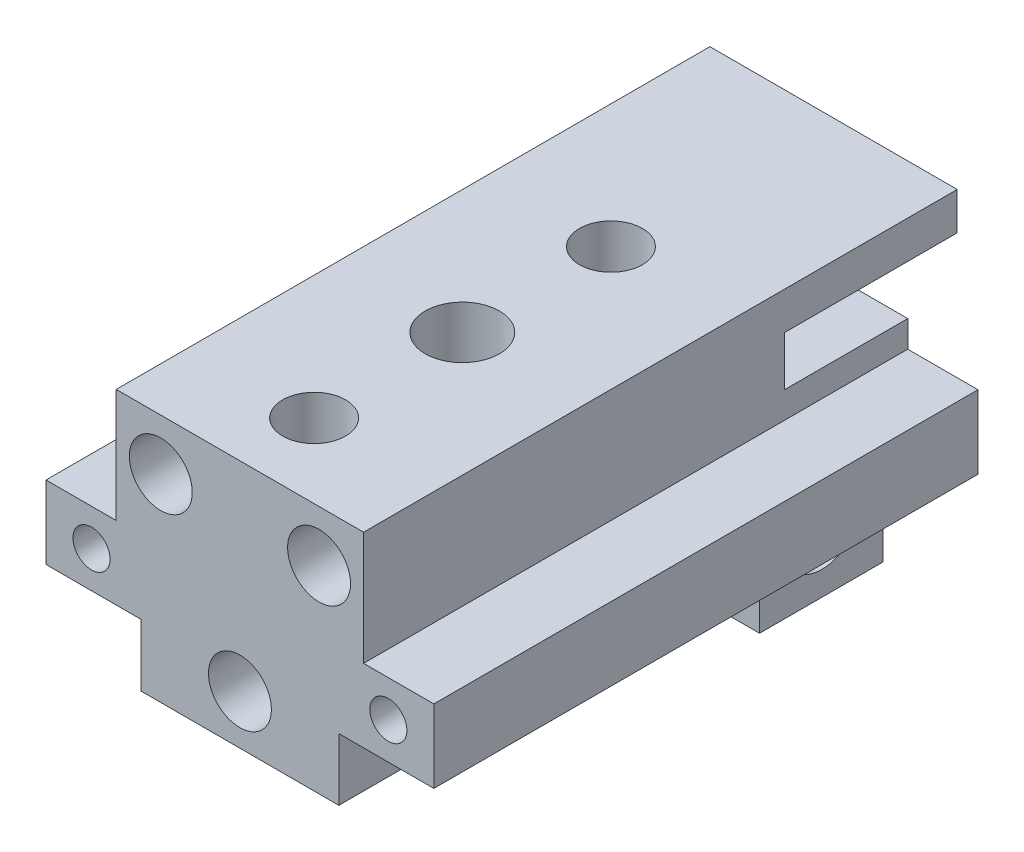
ISO-10303-21;
HEADER;
FILE_DESCRIPTION(('STEP AP214'),'2;1');
FILE_NAME('part.step','',(''),(''),'','','');
FILE_SCHEMA(('AUTOMOTIVE_DESIGN { 1 0 10303 214 1 1 1 1 }'));
ENDSEC;
DATA;
#1=APPLICATION_CONTEXT('core data for automotive mechanical design processes');
#2=APPLICATION_PROTOCOL_DEFINITION('international standard','automotive_design',2000,#1);
#3=PRODUCT_CONTEXT('',#1,'mechanical');
#4=PRODUCT('Part','Part','',(#3));
#5=PRODUCT_RELATED_PRODUCT_CATEGORY('part','',(#4));
#6=PRODUCT_DEFINITION_FORMATION('','',#4);
#7=PRODUCT_DEFINITION_CONTEXT('part definition',#1,'design');
#8=PRODUCT_DEFINITION('design','',#6,#7);
#9=PRODUCT_DEFINITION_SHAPE('','',#8);
#10=(LENGTH_UNIT() NAMED_UNIT(*) SI_UNIT(.MILLI.,.METRE.));
#11=(NAMED_UNIT(*) PLANE_ANGLE_UNIT() SI_UNIT($,.RADIAN.));
#12=(NAMED_UNIT(*) SI_UNIT($,.STERADIAN.) SOLID_ANGLE_UNIT());
#13=UNCERTAINTY_MEASURE_WITH_UNIT(LENGTH_MEASURE(1.E-05),#10,'distance_accuracy_value','');
#14=(GEOMETRIC_REPRESENTATION_CONTEXT(3) GLOBAL_UNCERTAINTY_ASSIGNED_CONTEXT((#13)) GLOBAL_UNIT_ASSIGNED_CONTEXT((#10,
#11,#12)) REPRESENTATION_CONTEXT('',''));
#15=CARTESIAN_POINT('',(0.,0.,0.));
#16=DIRECTION('',(0.,0.,1.));
#17=DIRECTION('',(1.,0.,0.));
#18=AXIS2_PLACEMENT_3D('',#15,#16,#17);
#19=CARTESIAN_POINT('',(-12.446,-9.9568,19.05));
#20=DIRECTION('',(0.,1.,0.));
#21=DIRECTION('',(0.,0.,1.));
#22=AXIS2_PLACEMENT_3D('',#19,#20,#21);
#23=PLANE('',#22);
#24=DIRECTION('',(1.,0.,0.));
#25=VECTOR('',#24,1.);
#26=CARTESIAN_POINT('',(-6.35,-9.9568,-7.95019999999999));
#27=LINE('',#26,#25);
#28=CARTESIAN_POINT('',(3.302,-9.9568,-7.95019999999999));
#29=VERTEX_POINT('',#28);
#30=CARTESIAN_POINT('',(6.35,-9.9568,-7.95019999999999));
#31=VERTEX_POINT('',#30);
#32=EDGE_CURVE('E511',#29,#31,#27,.T.);
#33=ORIENTED_EDGE('',*,*,#32,.F.);
#34=DIRECTION('',(0.,0.,-1.));
#35=VECTOR('',#34,1.);
#36=CARTESIAN_POINT('',(3.302,-9.9568,29.3657777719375));
#37=LINE('',#36,#35);
#38=CARTESIAN_POINT('',(3.302,-9.9568,-15.875));
#39=VERTEX_POINT('',#38);
#40=EDGE_CURVE('E323',#29,#39,#37,.T.);
#41=ORIENTED_EDGE('',*,*,#40,.T.);
#42=DIRECTION('',(-1.,0.,0.));
#43=VECTOR('',#42,1.);
#44=CARTESIAN_POINT('',(6.35,-9.9568,-15.875));
#45=LINE('',#44,#43);
#46=CARTESIAN_POINT('',(6.35,-9.9568,-15.875));
#47=VERTEX_POINT('',#46);
#48=EDGE_CURVE('E471',#47,#39,#45,.T.);
#49=ORIENTED_EDGE('',*,*,#48,.F.);
#50=DIRECTION('',(0.,0.,1.));
#51=VECTOR('',#50,1.);
#52=CARTESIAN_POINT('',(6.35,-9.9568,-19.05));
#53=LINE('',#52,#51);
#54=EDGE_CURVE('E574',#47,#31,#53,.T.);
#55=ORIENTED_EDGE('',*,*,#54,.T.);
#56=EDGE_LOOP('',(#33,#41,#49,#55));
#57=FACE_BOUND('',#56,.T.);
#58=ADVANCED_FACE('F39',(#57),#23,.F.);
#59=CARTESIAN_POINT('',(-6.35,-6.0198,-7.95019999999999));
#60=DIRECTION('',(0.,0.,-1.));
#61=DIRECTION('',(-1.,0.,0.));
#62=AXIS2_PLACEMENT_3D('',#59,#60,#61);
#63=PLANE('',#62);
#64=DIRECTION('',(-1.,0.,0.));
#65=VECTOR('',#64,1.);
#66=CARTESIAN_POINT('',(-6.35,-6.0198,-7.95019999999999));
#67=LINE('',#66,#65);
#68=CARTESIAN_POINT('',(6.35,-6.0198,-7.95019999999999));
#69=VERTEX_POINT('',#68);
#70=CARTESIAN_POINT('',(3.302,-6.0198,-7.95019999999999));
#71=VERTEX_POINT('',#70);
#72=EDGE_CURVE('E517',#69,#71,#67,.T.);
#73=ORIENTED_EDGE('',*,*,#72,.T.);
#74=DIRECTION('',(0.,-1.,0.));
#75=VECTOR('',#74,1.);
#76=CARTESIAN_POINT('',(3.302,-6.0198,-7.95019999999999));
#77=LINE('',#76,#75);
#78=EDGE_CURVE('E338',#71,#29,#77,.T.);
#79=ORIENTED_EDGE('',*,*,#78,.T.);
#80=ORIENTED_EDGE('',*,*,#32,.T.);
#81=DIRECTION('',(0.,1.,0.));
#82=VECTOR('',#81,1.);
#83=CARTESIAN_POINT('',(6.35,-9.9568,-7.95019999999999));
#84=LINE('',#83,#82);
#85=EDGE_CURVE('E514',#31,#69,#84,.T.);
#86=ORIENTED_EDGE('',*,*,#85,.T.);
#87=EDGE_LOOP('',(#73,#79,#80,#86));
#88=FACE_BOUND('',#87,.T.);
#89=ADVANCED_FACE('F398',(#88),#63,.F.);
#90=CARTESIAN_POINT('',(-12.446,-6.0198,-11.938));
#91=DIRECTION('',(1.,0.,0.));
#92=DIRECTION('',(0.,0.,-1.));
#93=AXIS2_PLACEMENT_3D('',#90,#91,#92);
#94=CYLINDRICAL_SURFACE('',#93,2.3876);
#95=CARTESIAN_POINT('',(3.302,-6.0198,-11.938));
#96=DIRECTION('',(1.,0.,0.));
#97=DIRECTION('',(0.,1.,0.));
#98=AXIS2_PLACEMENT_3D('',#95,#96,#97);
#99=CIRCLE('',#98,2.3876);
#100=CARTESIAN_POINT('',(3.302,-3.6322,-11.938));
#101=VERTEX_POINT('',#100);
#102=EDGE_CURVE('E337',#101,#101,#99,.F.);
#103=ORIENTED_EDGE('',*,*,#102,.T.);
#104=EDGE_LOOP('',(#103));
#105=FACE_BOUND('',#104,.T.);
#106=CARTESIAN_POINT('',(6.35,-6.0198,-11.938));
#107=DIRECTION('',(1.,0.,0.));
#108=DIRECTION('',(0.,0.,-1.));
#109=AXIS2_PLACEMENT_3D('',#106,#107,#108);
#110=CIRCLE('',#109,2.3876);
#111=CARTESIAN_POINT('',(6.35,-6.0198,-14.3256));
#112=VERTEX_POINT('',#111);
#113=EDGE_CURVE('E480',#112,#112,#110,.T.);
#114=ORIENTED_EDGE('',*,*,#113,.T.);
#115=EDGE_LOOP('',(#114));
#116=FACE_BOUND('',#115,.T.);
#117=ADVANCED_FACE('F385',(#105,#116),#94,.F.);
#118=CARTESIAN_POINT('',(-12.446,9.9568,-19.05));
#119=DIRECTION('',(1.,0.,0.));
#120=DIRECTION('',(0.,0.,-1.));
#121=AXIS2_PLACEMENT_3D('',#118,#119,#120);
#122=PLANE('',#121);
#123=DIRECTION('',(0.,1.,0.));
#124=VECTOR('',#123,1.);
#125=CARTESIAN_POINT('',(-12.446,-2.032,-15.875));
#126=LINE('',#125,#124);
#127=CARTESIAN_POINT('',(-12.446,-2.032,-15.875));
#128=VERTEX_POINT('',#127);
#129=CARTESIAN_POINT('',(-12.446,2.667,-15.875));
#130=VERTEX_POINT('',#129);
#131=EDGE_CURVE('E485',#128,#130,#126,.T.);
#132=ORIENTED_EDGE('',*,*,#131,.F.);
#133=DIRECTION('',(0.,0.,1.));
#134=VECTOR('',#133,1.);
#135=CARTESIAN_POINT('',(-12.446,-2.032,-19.05));
#136=LINE('',#135,#134);
#137=CARTESIAN_POINT('',(-12.446,-2.032,19.05));
#138=VERTEX_POINT('',#137);
#139=EDGE_CURVE('E562',#128,#138,#136,.T.);
#140=ORIENTED_EDGE('',*,*,#139,.T.);
#141=DIRECTION('',(0.,-1.,0.));
#142=VECTOR('',#141,1.);
#143=CARTESIAN_POINT('',(-12.446,9.9568,19.05));
#144=LINE('',#143,#142);
#145=CARTESIAN_POINT('',(-12.446,2.667,19.05));
#146=VERTEX_POINT('',#145);
#147=EDGE_CURVE('E618',#146,#138,#144,.T.);
#148=ORIENTED_EDGE('',*,*,#147,.F.);
#149=DIRECTION('',(0.,0.,1.));
#150=VECTOR('',#149,1.);
#151=CARTESIAN_POINT('',(-12.446,2.667,-19.05));
#152=LINE('',#151,#150);
#153=EDGE_CURVE('E598',#130,#146,#152,.T.);
#154=ORIENTED_EDGE('',*,*,#153,.F.);
#155=EDGE_LOOP('',(#132,#140,#148,#154));
#156=FACE_BOUND('',#155,.T.);
#157=ADVANCED_FACE('F41',(#156),#122,.F.);
#158=CARTESIAN_POINT('',(12.446,9.9568,-19.05));
#159=DIRECTION('',(-1.,0.,0.));
#160=DIRECTION('',(0.,0.,1.));
#161=AXIS2_PLACEMENT_3D('',#158,#159,#160);
#162=PLANE('',#161);
#163=DIRECTION('',(0.,-1.,0.));
#164=VECTOR('',#163,1.);
#165=CARTESIAN_POINT('',(12.446,2.667,-15.875));
#166=LINE('',#165,#164);
#167=CARTESIAN_POINT('',(12.446,2.667,-15.875));
#168=VERTEX_POINT('',#167);
#169=CARTESIAN_POINT('',(12.446,-2.032,-15.875));
#170=VERTEX_POINT('',#169);
#171=EDGE_CURVE('E496',#168,#170,#166,.T.);
#172=ORIENTED_EDGE('',*,*,#171,.F.);
#173=DIRECTION('',(0.,0.,1.));
#174=VECTOR('',#173,1.);
#175=CARTESIAN_POINT('',(12.446,2.667,-19.05));
#176=LINE('',#175,#174);
#177=CARTESIAN_POINT('',(12.446,2.667,19.05));
#178=VERTEX_POINT('',#177);
#179=EDGE_CURVE('E590',#168,#178,#176,.T.);
#180=ORIENTED_EDGE('',*,*,#179,.T.);
#181=DIRECTION('',(0.,-1.,0.));
#182=VECTOR('',#181,1.);
#183=CARTESIAN_POINT('',(12.446,9.9568,19.05));
#184=LINE('',#183,#182);
#185=CARTESIAN_POINT('',(12.446,-2.032,19.05));
#186=VERTEX_POINT('',#185);
#187=EDGE_CURVE('E615',#178,#186,#184,.T.);
#188=ORIENTED_EDGE('',*,*,#187,.T.);
#189=DIRECTION('',(0.,0.,1.));
#190=VECTOR('',#189,1.);
#191=CARTESIAN_POINT('',(12.446,-2.032,-19.05));
#192=LINE('',#191,#190);
#193=EDGE_CURVE('E573',#170,#186,#192,.T.);
#194=ORIENTED_EDGE('',*,*,#193,.F.);
#195=EDGE_LOOP('',(#172,#180,#188,#194));
#196=FACE_BOUND('',#195,.T.);
#197=ADVANCED_FACE('F451',(#196),#162,.F.);
#198=CARTESIAN_POINT('',(-3.302,-9.9568,-15.875));
#199=VERTEX_POINT('',#198);
#200=CARTESIAN_POINT('',(-6.35,-9.9568,-15.875));
#201=VERTEX_POINT('',#200);
#202=EDGE_CURVE('E465',#199,#201,#45,.T.);
#203=ORIENTED_EDGE('',*,*,#202,.F.);
#204=DIRECTION('',(0.,0.,-1.));
#205=VECTOR('',#204,1.);
#206=CARTESIAN_POINT('',(-3.302,-9.9568,29.3657777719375));
#207=LINE('',#206,#205);
#208=CARTESIAN_POINT('',(-3.302,-9.9568,-7.95019999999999));
#209=VERTEX_POINT('',#208);
#210=EDGE_CURVE('E327',#209,#199,#207,.T.);
#211=ORIENTED_EDGE('',*,*,#210,.F.);
#212=CARTESIAN_POINT('',(-6.35,-9.9568,-7.95019999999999));
#213=VERTEX_POINT('',#212);
#214=EDGE_CURVE('E512',#213,#209,#27,.T.);
#215=ORIENTED_EDGE('',*,*,#214,.F.);
#216=DIRECTION('',(0.,0.,1.));
#217=VECTOR('',#216,1.);
#218=CARTESIAN_POINT('',(-6.35,-9.9568,-19.05));
#219=LINE('',#218,#217);
#220=EDGE_CURVE('E468',#201,#213,#219,.T.);
#221=ORIENTED_EDGE('',*,*,#220,.F.);
#222=EDGE_LOOP('',(#203,#211,#215,#221));
#223=FACE_BOUND('',#222,.T.);
#224=ADVANCED_FACE('F441',(#223),#23,.F.);
#225=CARTESIAN_POINT('',(-12.446,2.667,-19.05));
#226=DIRECTION('',(0.,-1.,0.));
#227=DIRECTION('',(1.,0.,0.));
#228=AXIS2_PLACEMENT_3D('',#225,#226,#227);
#229=PLANE('',#228);
#230=DIRECTION('',(1.,0.,0.));
#231=VECTOR('',#230,1.);
#232=CARTESIAN_POINT('',(-12.446,2.667,-15.875));
#233=LINE('',#232,#231);
#234=CARTESIAN_POINT('',(-7.9375,2.667,-15.875));
#235=VERTEX_POINT('',#234);
#236=EDGE_CURVE('E487',#130,#235,#233,.T.);
#237=ORIENTED_EDGE('',*,*,#236,.F.);
#238=ORIENTED_EDGE('',*,*,#153,.T.);
#239=DIRECTION('',(1.,0.,0.));
#240=VECTOR('',#239,1.);
#241=CARTESIAN_POINT('',(-12.446,2.667,19.05));
#242=LINE('',#241,#240);
#243=CARTESIAN_POINT('',(-7.9375,2.667,19.05));
#244=VERTEX_POINT('',#243);
#245=EDGE_CURVE('E592',#146,#244,#242,.T.);
#246=ORIENTED_EDGE('',*,*,#245,.T.);
#247=DIRECTION('',(0.,0.,1.));
#248=VECTOR('',#247,1.);
#249=CARTESIAN_POINT('',(-7.9375,2.667,-19.05));
#250=LINE('',#249,#248);
#251=EDGE_CURVE('E607',#235,#244,#250,.T.);
#252=ORIENTED_EDGE('',*,*,#251,.F.);
#253=EDGE_LOOP('',(#237,#238,#246,#252));
#254=FACE_BOUND('',#253,.T.);
#255=ADVANCED_FACE('F450',(#254),#229,.F.);
#256=CARTESIAN_POINT('',(12.446,2.667,-19.05));
#257=DIRECTION('',(0.,-1.,0.));
#258=DIRECTION('',(1.,0.,0.));
#259=AXIS2_PLACEMENT_3D('',#256,#257,#258);
#260=PLANE('',#259);
#261=DIRECTION('',(1.,0.,0.));
#262=VECTOR('',#261,1.);
#263=CARTESIAN_POINT('',(7.9375,2.667,-15.875));
#264=LINE('',#263,#262);
#265=CARTESIAN_POINT('',(7.9375,2.667,-15.875));
#266=VERTEX_POINT('',#265);
#267=EDGE_CURVE('E494',#266,#168,#264,.T.);
#268=ORIENTED_EDGE('',*,*,#267,.F.);
#269=DIRECTION('',(0.,0.,1.));
#270=VECTOR('',#269,1.);
#271=CARTESIAN_POINT('',(7.9375,2.667,-19.05));
#272=LINE('',#271,#270);
#273=CARTESIAN_POINT('',(7.9375,2.667,19.05));
#274=VERTEX_POINT('',#273);
#275=EDGE_CURVE('E593',#266,#274,#272,.T.);
#276=ORIENTED_EDGE('',*,*,#275,.T.);
#277=DIRECTION('',(1.,0.,0.));
#278=VECTOR('',#277,1.);
#279=CARTESIAN_POINT('',(12.446,2.667,19.05));
#280=LINE('',#279,#278);
#281=EDGE_CURVE('E585',#274,#178,#280,.T.);
#282=ORIENTED_EDGE('',*,*,#281,.T.);
#283=ORIENTED_EDGE('',*,*,#179,.F.);
#284=EDGE_LOOP('',(#268,#276,#282,#283));
#285=FACE_BOUND('',#284,.T.);
#286=ADVANCED_FACE('F457',(#285),#260,.F.);
#287=CARTESIAN_POINT('',(6.35,-9.9568,-19.05));
#288=DIRECTION('',(-1.,0.,0.));
#289=DIRECTION('',(0.,0.,1.));
#290=AXIS2_PLACEMENT_3D('',#287,#288,#289);
#291=PLANE('',#290);
#292=ORIENTED_EDGE('',*,*,#113,.F.);
#293=EDGE_LOOP('',(#292));
#294=FACE_BOUND('',#293,.T.);
#295=DIRECTION('',(0.,-1.,0.));
#296=VECTOR('',#295,1.);
#297=CARTESIAN_POINT('',(6.35,-2.032,-15.875));
#298=LINE('',#297,#296);
#299=CARTESIAN_POINT('',(6.35,-2.032,-15.875));
#300=VERTEX_POINT('',#299);
#301=EDGE_CURVE('E500',#300,#47,#298,.T.);
#302=ORIENTED_EDGE('',*,*,#301,.F.);
#303=DIRECTION('',(0.,0.,1.));
#304=VECTOR('',#303,1.);
#305=CARTESIAN_POINT('',(6.35,-2.032,-19.05));
#306=LINE('',#305,#304);
#307=CARTESIAN_POINT('',(6.35,-2.032,19.05));
#308=VERTEX_POINT('',#307);
#309=EDGE_CURVE('E578',#300,#308,#306,.T.);
#310=ORIENTED_EDGE('',*,*,#309,.T.);
#311=DIRECTION('',(0.,-1.,0.));
#312=VECTOR('',#311,1.);
#313=CARTESIAN_POINT('',(6.35,-9.9568,19.05));
#314=LINE('',#313,#312);
#315=CARTESIAN_POINT('',(6.35,-6.0198,19.05));
#316=VERTEX_POINT('',#315);
#317=EDGE_CURVE('E570',#308,#316,#314,.T.);
#318=ORIENTED_EDGE('',*,*,#317,.T.);
#319=DIRECTION('',(0.,0.,1.));
#320=VECTOR('',#319,1.);
#321=CARTESIAN_POINT('',(6.35,-6.0198,-7.95019999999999));
#322=LINE('',#321,#320);
#323=EDGE_CURVE('E520',#69,#316,#322,.T.);
#324=ORIENTED_EDGE('',*,*,#323,.F.);
#325=ORIENTED_EDGE('',*,*,#85,.F.);
#326=ORIENTED_EDGE('',*,*,#54,.F.);
#327=EDGE_LOOP('',(#302,#310,#318,#324,#325,#326));
#328=FACE_BOUND('',#327,.T.);
#329=ADVANCED_FACE('F672',(#294,#328),#291,.F.);
#330=CARTESIAN_POINT('',(12.446,-2.032,-19.05));
#331=DIRECTION('',(0.,1.,0.));
#332=DIRECTION('',(-1.,0.,0.));
#333=AXIS2_PLACEMENT_3D('',#330,#331,#332);
#334=PLANE('',#333);
#335=DIRECTION('',(-1.,0.,0.));
#336=VECTOR('',#335,1.);
#337=CARTESIAN_POINT('',(12.446,-2.032,-15.875));
#338=LINE('',#337,#336);
#339=EDGE_CURVE('E498',#170,#300,#338,.T.);
#340=ORIENTED_EDGE('',*,*,#339,.F.);
#341=ORIENTED_EDGE('',*,*,#193,.T.);
#342=DIRECTION('',(-1.,0.,0.));
#343=VECTOR('',#342,1.);
#344=CARTESIAN_POINT('',(12.446,-2.032,19.05));
#345=LINE('',#344,#343);
#346=EDGE_CURVE('E564',#186,#308,#345,.T.);
#347=ORIENTED_EDGE('',*,*,#346,.T.);
#348=ORIENTED_EDGE('',*,*,#309,.F.);
#349=EDGE_LOOP('',(#340,#341,#347,#348));
#350=FACE_BOUND('',#349,.T.);
#351=ADVANCED_FACE('F675',(#350),#334,.F.);
#352=CARTESIAN_POINT('',(-12.446,-2.032,-19.05));
#353=DIRECTION('',(0.,1.,0.));
#354=DIRECTION('',(-1.,0.,0.));
#355=AXIS2_PLACEMENT_3D('',#352,#353,#354);
#356=PLANE('',#355);
#357=DIRECTION('',(-1.,0.,0.));
#358=VECTOR('',#357,1.);
#359=CARTESIAN_POINT('',(-6.35,-2.032,-15.875));
#360=LINE('',#359,#358);
#361=CARTESIAN_POINT('',(-6.35,-2.032,-15.875));
#362=VERTEX_POINT('',#361);
#363=EDGE_CURVE('E483',#362,#128,#360,.T.);
#364=ORIENTED_EDGE('',*,*,#363,.F.);
#365=DIRECTION('',(0.,0.,1.));
#366=VECTOR('',#365,1.);
#367=CARTESIAN_POINT('',(-6.35,-2.032,-19.05));
#368=LINE('',#367,#366);
#369=CARTESIAN_POINT('',(-6.35,-2.032,19.05));
#370=VERTEX_POINT('',#369);
#371=EDGE_CURVE('E565',#362,#370,#368,.T.);
#372=ORIENTED_EDGE('',*,*,#371,.T.);
#373=DIRECTION('',(-1.,0.,0.));
#374=VECTOR('',#373,1.);
#375=CARTESIAN_POINT('',(-12.446,-2.032,19.05));
#376=LINE('',#375,#374);
#377=EDGE_CURVE('E559',#370,#138,#376,.T.);
#378=ORIENTED_EDGE('',*,*,#377,.T.);
#379=ORIENTED_EDGE('',*,*,#139,.F.);
#380=EDGE_LOOP('',(#364,#372,#378,#379));
#381=FACE_BOUND('',#380,.T.);
#382=ADVANCED_FACE('F704',(#381),#356,.F.);
#383=CARTESIAN_POINT('',(-6.35,-9.9568,-19.05));
#384=DIRECTION('',(1.,0.,0.));
#385=DIRECTION('',(0.,0.,-1.));
#386=AXIS2_PLACEMENT_3D('',#383,#384,#385);
#387=PLANE('',#386);
#388=CARTESIAN_POINT('',(-6.35,-6.0198,-11.938));
#389=DIRECTION('',(1.,0.,0.));
#390=DIRECTION('',(0.,0.,-1.));
#391=AXIS2_PLACEMENT_3D('',#388,#389,#390);
#392=CIRCLE('',#391,2.3876);
#393=CARTESIAN_POINT('',(-6.35,-6.0198,-14.3256));
#394=VERTEX_POINT('',#393);
#395=EDGE_CURVE('E476',#394,#394,#392,.T.);
#396=ORIENTED_EDGE('',*,*,#395,.T.);
#397=EDGE_LOOP('',(#396));
#398=FACE_BOUND('',#397,.T.);
#399=DIRECTION('',(0.,1.,0.));
#400=VECTOR('',#399,1.);
#401=CARTESIAN_POINT('',(-6.35,-9.9568,-15.875));
#402=LINE('',#401,#400);
#403=EDGE_CURVE('E475',#201,#362,#402,.T.);
#404=ORIENTED_EDGE('',*,*,#403,.F.);
#405=ORIENTED_EDGE('',*,*,#220,.T.);
#406=DIRECTION('',(0.,-1.,0.));
#407=VECTOR('',#406,1.);
#408=CARTESIAN_POINT('',(-6.35,-9.9568,-7.95019999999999));
#409=LINE('',#408,#407);
#410=CARTESIAN_POINT('',(-6.35,-6.0198,-7.95019999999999));
#411=VERTEX_POINT('',#410);
#412=EDGE_CURVE('E508',#411,#213,#409,.T.);
#413=ORIENTED_EDGE('',*,*,#412,.F.);
#414=DIRECTION('',(0.,0.,1.));
#415=VECTOR('',#414,1.);
#416=CARTESIAN_POINT('',(-6.35,-6.0198,-7.95019999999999));
#417=LINE('',#416,#415);
#418=CARTESIAN_POINT('',(-6.35,-6.0198,19.05));
#419=VERTEX_POINT('',#418);
#420=EDGE_CURVE('E522',#411,#419,#417,.T.);
#421=ORIENTED_EDGE('',*,*,#420,.T.);
#422=DIRECTION('',(0.,1.,0.));
#423=VECTOR('',#422,1.);
#424=CARTESIAN_POINT('',(-6.35,-9.9568,19.05));
#425=LINE('',#424,#423);
#426=EDGE_CURVE('E556',#419,#370,#425,.T.);
#427=ORIENTED_EDGE('',*,*,#426,.T.);
#428=ORIENTED_EDGE('',*,*,#371,.F.);
#429=EDGE_LOOP('',(#404,#405,#413,#421,#427,#428));
#430=FACE_BOUND('',#429,.T.);
#431=ADVANCED_FACE('F696',(#398,#430),#387,.F.);
#432=CARTESIAN_POINT('',(-12.446,9.9568,19.05));
#433=DIRECTION('',(0.,0.,-1.));
#434=DIRECTION('',(-1.,0.,0.));
#435=AXIS2_PLACEMENT_3D('',#432,#433,#434);
#436=PLANE('',#435);
#437=CARTESIAN_POINT('',(9.525,0.3175,19.05));
#438=DIRECTION('',(0.,0.,1.));
#439=DIRECTION('',(1.,0.,0.));
#440=AXIS2_PLACEMENT_3D('',#437,#438,#439);
#441=CIRCLE('',#440,1.190625);
#442=CARTESIAN_POINT('',(10.715625,0.3175,19.05));
#443=VERTEX_POINT('',#442);
#444=EDGE_CURVE('E525',#443,#443,#441,.T.);
#445=ORIENTED_EDGE('',*,*,#444,.F.);
#446=EDGE_LOOP('',(#445));
#447=FACE_BOUND('',#446,.T.);
#448=CARTESIAN_POINT('',(-9.525,0.3175,19.05));
#449=DIRECTION('',(0.,0.,1.));
#450=DIRECTION('',(1.,0.,0.));
#451=AXIS2_PLACEMENT_3D('',#448,#449,#450);
#452=CIRCLE('',#451,1.190625);
#453=CARTESIAN_POINT('',(-8.334375,0.3175,19.05));
#454=VERTEX_POINT('',#453);
#455=EDGE_CURVE('E532',#454,#454,#452,.T.);
#456=ORIENTED_EDGE('',*,*,#455,.F.);
#457=EDGE_LOOP('',(#456));
#458=FACE_BOUND('',#457,.T.);
#459=CARTESIAN_POINT('',(-5.08,6.6675,19.05));
#460=DIRECTION('',(0.,0.,1.));
#461=DIRECTION('',(1.,0.,0.));
#462=AXIS2_PLACEMENT_3D('',#459,#460,#461);
#463=CIRCLE('',#462,2.01929999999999);
#464=CARTESIAN_POINT('',(-3.06070000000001,6.6675,19.05));
#465=VERTEX_POINT('',#464);
#466=EDGE_CURVE('E541',#465,#465,#463,.T.);
#467=ORIENTED_EDGE('',*,*,#466,.F.);
#468=EDGE_LOOP('',(#467));
#469=FACE_BOUND('',#468,.T.);
#470=CARTESIAN_POINT('',(5.08,6.6675,19.05));
#471=DIRECTION('',(0.,0.,1.));
#472=DIRECTION('',(1.,0.,0.));
#473=AXIS2_PLACEMENT_3D('',#470,#471,#472);
#474=CIRCLE('',#473,2.01929999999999);
#475=CARTESIAN_POINT('',(7.09929999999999,6.6675,19.05));
#476=VERTEX_POINT('',#475);
#477=EDGE_CURVE('E547',#476,#476,#474,.T.);
#478=ORIENTED_EDGE('',*,*,#477,.F.);
#479=EDGE_LOOP('',(#478));
#480=FACE_BOUND('',#479,.T.);
#481=CARTESIAN_POINT('',(0.,-2.8575,19.05));
#482=DIRECTION('',(0.,0.,1.));
#483=DIRECTION('',(1.,0.,0.));
#484=AXIS2_PLACEMENT_3D('',#481,#482,#483);
#485=CIRCLE('',#484,2.01929999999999);
#486=CARTESIAN_POINT('',(2.01929999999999,-2.8575,19.05));
#487=VERTEX_POINT('',#486);
#488=EDGE_CURVE('E553',#487,#487,#485,.T.);
#489=ORIENTED_EDGE('',*,*,#488,.F.);
#490=EDGE_LOOP('',(#489));
#491=FACE_BOUND('',#490,.T.);
#492=ORIENTED_EDGE('',*,*,#426,.F.);
#493=DIRECTION('',(-1.,0.,0.));
#494=VECTOR('',#493,1.);
#495=CARTESIAN_POINT('',(-6.35,-6.0198,19.05));
#496=LINE('',#495,#494);
#497=EDGE_CURVE('E506',#316,#419,#496,.T.);
#498=ORIENTED_EDGE('',*,*,#497,.F.);
#499=ORIENTED_EDGE('',*,*,#317,.F.);
#500=ORIENTED_EDGE('',*,*,#346,.F.);
#501=ORIENTED_EDGE('',*,*,#187,.F.);
#502=ORIENTED_EDGE('',*,*,#281,.F.);
#503=DIRECTION('',(0.,-1.,0.));
#504=VECTOR('',#503,1.);
#505=CARTESIAN_POINT('',(7.9375,9.9568,19.05));
#506=LINE('',#505,#504);
#507=CARTESIAN_POINT('',(7.9375,9.9568,19.05));
#508=VERTEX_POINT('',#507);
#509=EDGE_CURVE('E577',#508,#274,#506,.T.);
#510=ORIENTED_EDGE('',*,*,#509,.F.);
#511=DIRECTION('',(1.,0.,0.));
#512=VECTOR('',#511,1.);
#513=CARTESIAN_POINT('',(-12.446,9.9568,19.05));
#514=LINE('',#513,#512);
#515=CARTESIAN_POINT('',(-7.9375,9.9568,19.05));
#516=VERTEX_POINT('',#515);
#517=EDGE_CURVE('E606',#516,#508,#514,.T.);
#518=ORIENTED_EDGE('',*,*,#517,.F.);
#519=DIRECTION('',(0.,1.,0.));
#520=VECTOR('',#519,1.);
#521=CARTESIAN_POINT('',(-7.9375,9.9568,19.05));
#522=LINE('',#521,#520);
#523=EDGE_CURVE('E599',#244,#516,#522,.T.);
#524=ORIENTED_EDGE('',*,*,#523,.F.);
#525=ORIENTED_EDGE('',*,*,#245,.F.);
#526=ORIENTED_EDGE('',*,*,#147,.T.);
#527=ORIENTED_EDGE('',*,*,#377,.F.);
#528=EDGE_LOOP('',(#492,#498,#499,#500,#501,#502,#510,#518,#524,#525,#526,#527));
#529=FACE_BOUND('',#528,.T.);
#530=ADVANCED_FACE('F691',(#447,#458,#469,#480,#491,#529),#436,.F.);
#531=CARTESIAN_POINT('',(-12.446,9.9568,-19.05));
#532=DIRECTION('',(0.,0.,1.));
#533=DIRECTION('',(1.,0.,0.));
#534=AXIS2_PLACEMENT_3D('',#531,#532,#533);
#535=PLANE('',#534);
#536=DIRECTION('',(0.,-1.,0.));
#537=VECTOR('',#536,1.);
#538=CARTESIAN_POINT('',(7.9375,9.9568,-19.05));
#539=LINE('',#538,#537);
#540=CARTESIAN_POINT('',(7.9375,9.9568,-19.05));
#541=VERTEX_POINT('',#540);
#542=CARTESIAN_POINT('',(7.9375,7.5438,-19.05));
#543=VERTEX_POINT('',#542);
#544=EDGE_CURVE('E581',#541,#543,#539,.T.);
#545=ORIENTED_EDGE('',*,*,#544,.T.);
#546=DIRECTION('',(1.,0.,0.));
#547=VECTOR('',#546,1.);
#548=CARTESIAN_POINT('',(7.9375,7.5438,-19.05));
#549=LINE('',#548,#547);
#550=CARTESIAN_POINT('',(-7.9375,7.5438,-19.05));
#551=VERTEX_POINT('',#550);
#552=EDGE_CURVE('E472',#551,#543,#549,.T.);
#553=ORIENTED_EDGE('',*,*,#552,.F.);
#554=DIRECTION('',(0.,1.,0.));
#555=VECTOR('',#554,1.);
#556=CARTESIAN_POINT('',(-7.9375,9.9568,-19.05));
#557=LINE('',#556,#555);
#558=CARTESIAN_POINT('',(-7.9375,9.9568,-19.05));
#559=VERTEX_POINT('',#558);
#560=EDGE_CURVE('E596',#551,#559,#557,.T.);
#561=ORIENTED_EDGE('',*,*,#560,.T.);
#562=DIRECTION('',(-1.,0.,0.));
#563=VECTOR('',#562,1.);
#564=CARTESIAN_POINT('',(-12.446,9.9568,-19.05));
#565=LINE('',#564,#563);
#566=EDGE_CURVE('E612',#541,#559,#565,.T.);
#567=ORIENTED_EDGE('',*,*,#566,.F.);
#568=EDGE_LOOP('',(#545,#553,#561,#567));
#569=FACE_BOUND('',#568,.T.);
#570=ADVANCED_FACE('F722',(#569),#535,.F.);
#571=CARTESIAN_POINT('',(-12.446,9.9568,19.05));
#572=DIRECTION('',(0.,1.,0.));
#573=DIRECTION('',(0.,0.,1.));
#574=AXIS2_PLACEMENT_3D('',#571,#572,#573);
#575=PLANE('',#574);
#576=CARTESIAN_POINT('',(0.,9.9568,4.7752));
#577=DIRECTION('',(0.,1.,0.));
#578=DIRECTION('',(0.,0.,1.));
#579=AXIS2_PLACEMENT_3D('',#576,#577,#578);
#580=CIRCLE('',#579,2.38125000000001);
#581=CARTESIAN_POINT('',(0.,9.9568,7.15645000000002));
#582=VERTEX_POINT('',#581);
#583=EDGE_CURVE('E295',#582,#582,#580,.T.);
#584=ORIENTED_EDGE('',*,*,#583,.F.);
#585=EDGE_LOOP('',(#584));
#586=FACE_BOUND('',#585,.T.);
#587=CARTESIAN_POINT('',(0.,9.9568,14.2875));
#588=DIRECTION('',(0.,1.,0.));
#589=DIRECTION('',(0.,0.,1.));
#590=AXIS2_PLACEMENT_3D('',#587,#588,#589);
#591=CIRCLE('',#590,2.01929999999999);
#592=CARTESIAN_POINT('',(0.,9.9568,16.3068));
#593=VERTEX_POINT('',#592);
#594=EDGE_CURVE('E250',#593,#593,#591,.T.);
#595=ORIENTED_EDGE('',*,*,#594,.F.);
#596=EDGE_LOOP('',(#595));
#597=FACE_BOUND('',#596,.T.);
#598=CARTESIAN_POINT('',(0.,9.9568,-4.7625));
#599=DIRECTION('',(0.,1.,0.));
#600=DIRECTION('',(0.,0.,1.));
#601=AXIS2_PLACEMENT_3D('',#598,#599,#600);
#602=CIRCLE('',#601,2.01929999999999);
#603=CARTESIAN_POINT('',(0.,9.9568,-2.74320000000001));
#604=VERTEX_POINT('',#603);
#605=EDGE_CURVE('E301',#604,#604,#602,.T.);
#606=ORIENTED_EDGE('',*,*,#605,.F.);
#607=EDGE_LOOP('',(#606));
#608=FACE_BOUND('',#607,.T.);
#609=DIRECTION('',(0.,0.,1.));
#610=VECTOR('',#609,1.);
#611=CARTESIAN_POINT('',(7.9375,9.9568,-19.05));
#612=LINE('',#611,#610);
#613=EDGE_CURVE('E584',#541,#508,#612,.T.);
#614=ORIENTED_EDGE('',*,*,#613,.F.);
#615=ORIENTED_EDGE('',*,*,#566,.T.);
#616=DIRECTION('',(0.,0.,1.));
#617=VECTOR('',#616,1.);
#618=CARTESIAN_POINT('',(-7.9375,9.9568,-19.05));
#619=LINE('',#618,#617);
#620=EDGE_CURVE('E603',#559,#516,#619,.T.);
#621=ORIENTED_EDGE('',*,*,#620,.T.);
#622=ORIENTED_EDGE('',*,*,#517,.T.);
#623=EDGE_LOOP('',(#614,#615,#621,#622));
#624=FACE_BOUND('',#623,.T.);
#625=ADVANCED_FACE('F719',(#586,#597,#608,#624),#575,.T.);
#626=CARTESIAN_POINT('',(-7.9375,9.9568,-19.05));
#627=DIRECTION('',(1.,0.,0.));
#628=DIRECTION('',(0.,0.,-1.));
#629=AXIS2_PLACEMENT_3D('',#626,#627,#628);
#630=PLANE('',#629);
#631=DIRECTION('',(0.,-1.,0.));
#632=VECTOR('',#631,1.);
#633=CARTESIAN_POINT('',(-7.9375,9.9568,-7.9502));
#634=LINE('',#633,#632);
#635=CARTESIAN_POINT('',(-7.9375,7.5438,-7.9502));
#636=VERTEX_POINT('',#635);
#637=CARTESIAN_POINT('',(-7.9375,4.3688,-7.9502));
#638=VERTEX_POINT('',#637);
#639=EDGE_CURVE('E664',#636,#638,#634,.T.);
#640=ORIENTED_EDGE('',*,*,#639,.T.);
#641=DIRECTION('',(0.,0.,-1.));
#642=VECTOR('',#641,1.);
#643=CARTESIAN_POINT('',(-7.9375,4.3688,-19.05));
#644=LINE('',#643,#642);
#645=CARTESIAN_POINT('',(-7.9375,4.3688,-15.875));
#646=VERTEX_POINT('',#645);
#647=EDGE_CURVE('E660',#638,#646,#644,.T.);
#648=ORIENTED_EDGE('',*,*,#647,.T.);
#649=DIRECTION('',(0.,1.,0.));
#650=VECTOR('',#649,1.);
#651=CARTESIAN_POINT('',(-7.9375,2.667,-15.875));
#652=LINE('',#651,#650);
#653=EDGE_CURVE('E489',#235,#646,#652,.T.);
#654=ORIENTED_EDGE('',*,*,#653,.F.);
#655=ORIENTED_EDGE('',*,*,#251,.T.);
#656=ORIENTED_EDGE('',*,*,#523,.T.);
#657=ORIENTED_EDGE('',*,*,#620,.F.);
#658=ORIENTED_EDGE('',*,*,#560,.F.);
#659=DIRECTION('',(0.,0.,-1.));
#660=VECTOR('',#659,1.);
#661=CARTESIAN_POINT('',(-7.9375,7.5438,-15.875));
#662=LINE('',#661,#660);
#663=EDGE_CURVE('E501',#636,#551,#662,.T.);
#664=ORIENTED_EDGE('',*,*,#663,.F.);
#665=EDGE_LOOP('',(#640,#648,#654,#655,#656,#657,#658,#664));
#666=FACE_BOUND('',#665,.T.);
#667=ADVANCED_FACE('F714',(#666),#630,.F.);
#668=CARTESIAN_POINT('',(7.9375,9.9568,-19.05));
#669=DIRECTION('',(-1.,0.,0.));
#670=DIRECTION('',(0.,0.,1.));
#671=AXIS2_PLACEMENT_3D('',#668,#669,#670);
#672=PLANE('',#671);
#673=DIRECTION('',(0.,-1.,0.));
#674=VECTOR('',#673,1.);
#675=CARTESIAN_POINT('',(7.9375,7.5438,-15.875));
#676=LINE('',#675,#674);
#677=CARTESIAN_POINT('',(7.9375,4.3688,-15.875));
#678=VERTEX_POINT('',#677);
#679=EDGE_CURVE('E492',#678,#266,#676,.T.);
#680=ORIENTED_EDGE('',*,*,#679,.F.);
#681=DIRECTION('',(0.,0.,-1.));
#682=VECTOR('',#681,1.);
#683=CARTESIAN_POINT('',(7.9375,4.3688,-15.875));
#684=LINE('',#683,#682);
#685=CARTESIAN_POINT('',(7.9375,4.3688,-7.9502));
#686=VERTEX_POINT('',#685);
#687=EDGE_CURVE('E653',#686,#678,#684,.T.);
#688=ORIENTED_EDGE('',*,*,#687,.F.);
#689=DIRECTION('',(0.,-1.,0.));
#690=VECTOR('',#689,1.);
#691=CARTESIAN_POINT('',(7.9375,7.5438,-7.9502));
#692=LINE('',#691,#690);
#693=CARTESIAN_POINT('',(7.9375,7.5438,-7.9502));
#694=VERTEX_POINT('',#693);
#695=EDGE_CURVE('E650',#694,#686,#692,.T.);
#696=ORIENTED_EDGE('',*,*,#695,.F.);
#697=DIRECTION('',(0.,0.,-1.));
#698=VECTOR('',#697,1.);
#699=CARTESIAN_POINT('',(7.9375,7.5438,-15.875));
#700=LINE('',#699,#698);
#701=EDGE_CURVE('E503',#694,#543,#700,.T.);
#702=ORIENTED_EDGE('',*,*,#701,.T.);
#703=ORIENTED_EDGE('',*,*,#544,.F.);
#704=ORIENTED_EDGE('',*,*,#613,.T.);
#705=ORIENTED_EDGE('',*,*,#509,.T.);
#706=ORIENTED_EDGE('',*,*,#275,.F.);
#707=EDGE_LOOP('',(#680,#688,#696,#702,#703,#704,#705,#706));
#708=FACE_BOUND('',#707,.T.);
#709=ADVANCED_FACE('F729',(#708),#672,.F.);
#710=CARTESIAN_POINT('',(0.,-2.8575,19.05));
#711=DIRECTION('',(0.,0.,1.));
#712=DIRECTION('',(1.,0.,0.));
#713=AXIS2_PLACEMENT_3D('',#710,#711,#712);
#714=CYLINDRICAL_SURFACE('',#713,2.01929999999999);
#715=CARTESIAN_POINT('',(1.98981426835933,-2.51368076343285,17.6675488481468));
#716=CARTESIAN_POINT('',(1.99736606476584,-2.5574063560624,17.5786531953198));
#717=CARTESIAN_POINT('',(2.00342748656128,-2.601059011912,17.4896057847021));
#718=CARTESIAN_POINT('',(2.01265993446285,-2.68811027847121,17.3112449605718));
#719=CARTESIAN_POINT('',(2.01583117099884,-2.73150890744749,17.2219315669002));
#720=CARTESIAN_POINT('',(2.02114679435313,-2.86118001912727,16.9536106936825));
#721=CARTESIAN_POINT('',(2.01909156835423,-2.9469186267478,16.7742409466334));
#722=CARTESIAN_POINT('',(2.00793864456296,-3.07610348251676,16.4986782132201));
#723=CARTESIAN_POINT('',(2.00258167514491,-3.12058612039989,16.4027948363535));
#724=CARTESIAN_POINT('',(1.98907552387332,-3.20838681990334,16.2106929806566));
#725=CARTESIAN_POINT('',(1.98092648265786,-3.25170494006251,16.1144745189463));
#726=CARTESIAN_POINT('',(1.96211084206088,-3.33664872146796,15.9216099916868));
#727=CARTESIAN_POINT('',(1.95144578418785,-3.37827540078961,15.8249642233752));
#728=CARTESIAN_POINT('',(1.92806376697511,-3.45908621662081,15.630874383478));
#729=CARTESIAN_POINT('',(1.91534643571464,-3.49826990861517,15.5334301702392));
#730=CARTESIAN_POINT('',(1.89118669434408,-3.56604365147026,15.3551533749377));
#731=CARTESIAN_POINT('',(1.87993530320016,-3.59526184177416,15.2745353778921));
#732=CARTESIAN_POINT('',(1.85753967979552,-3.64995733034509,15.1120438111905));
#733=CARTESIAN_POINT('',(1.84639539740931,-3.67543646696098,15.0301708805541));
#734=CARTESIAN_POINT('',(1.82583663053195,-3.72033782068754,14.8664371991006));
#735=CARTESIAN_POINT('',(1.81639001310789,-3.73987885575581,14.7846142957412));
#736=CARTESIAN_POINT('',(1.80087112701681,-3.771147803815,14.6192005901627));
#737=CARTESIAN_POINT('',(1.79479307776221,-3.78288910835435,14.5356130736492));
#738=CARTESIAN_POINT('',(1.78848351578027,-3.79501722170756,14.3831286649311));
#739=CARTESIAN_POINT('',(1.78737038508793,-3.79711841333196,14.3144115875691));
#740=CARTESIAN_POINT('',(1.78884335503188,-3.79431044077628,14.1771457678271));
#741=CARTESIAN_POINT('',(1.79143072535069,-3.78939887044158,14.1085970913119));
#742=CARTESIAN_POINT('',(1.79971228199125,-3.77329747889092,13.972074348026));
#743=CARTESIAN_POINT('',(1.8054244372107,-3.76207133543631,13.9041059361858));
#744=CARTESIAN_POINT('',(1.81888661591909,-3.73468604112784,13.7693933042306));
#745=CARTESIAN_POINT('',(1.82663748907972,-3.71852483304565,13.7026496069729));
#746=CARTESIAN_POINT('',(1.8454198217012,-3.67763907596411,13.5520686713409));
#747=CARTESIAN_POINT('',(1.85676693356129,-3.65178191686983,13.4685851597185));
#748=CARTESIAN_POINT('',(1.87386895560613,-3.61010660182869,13.3444702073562));
#749=CARTESIAN_POINT('',(1.87957756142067,-3.59574869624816,13.3033233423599));
#750=CARTESIAN_POINT('',(1.89090800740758,-3.56622350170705,13.2213007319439));
#751=CARTESIAN_POINT('',(1.89652983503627,-3.55105609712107,13.1804250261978));
#752=CARTESIAN_POINT('',(1.9146733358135,-3.50015534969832,13.0465232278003));
#753=CARTESIAN_POINT('',(1.92677997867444,-3.46303574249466,12.9539678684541));
#754=CARTESIAN_POINT('',(1.94917692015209,-3.38653381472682,12.7695689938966));
#755=CARTESIAN_POINT('',(1.95946696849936,-3.34715118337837,12.6777255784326));
#756=CARTESIAN_POINT('',(1.97781138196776,-3.26680885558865,12.4944629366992));
#757=CARTESIAN_POINT('',(1.98586488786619,-3.22584855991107,12.4030438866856));
#758=CARTESIAN_POINT('',(1.99948435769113,-3.14281905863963,12.2205235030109));
#759=CARTESIAN_POINT('',(2.00505022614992,-3.10074981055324,12.1294221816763));
#760=CARTESIAN_POINT('',(2.01778044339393,-2.97333277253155,11.8564160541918));
#761=CARTESIAN_POINT('',(2.02097188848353,-2.88679933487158,11.6748619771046));
#762=CARTESIAN_POINT('',(2.01596122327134,-2.71217913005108,11.312730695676));
#763=CARTESIAN_POINT('',(2.00776384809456,-2.62409302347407,11.1321531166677));
#764=CARTESIAN_POINT('',(1.98923940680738,-2.50934755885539,10.8986055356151));
#765=CARTESIAN_POINT('',(1.98444555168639,-2.48296882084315,10.8450302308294));
#766=CARTESIAN_POINT('',(1.97375350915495,-2.43018945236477,10.7380385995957));
#767=CARTESIAN_POINT('',(1.96785594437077,-2.40378884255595,10.6846222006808));
#768=CARTESIAN_POINT('',(1.96139139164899,-2.37737887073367,10.6312755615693));
#769=B_SPLINE_CURVE_WITH_KNOTS('',3,(#715,#716,#717,#718,#719,#720,#721,#722,#723,#724,#725,
#726,#727,#728,#729,#730,#731,#732,#733,#734,#735,#736,#737,#738,#739,#740,#741,#742,#743,#744,
#745,#746,#747,#748,#749,#750,#751,#752,#753,#754,#755,#756,#757,#758,#759,#760,#761,#762,#763,
#764,#765,#766,#767,#768),.UNSPECIFIED.,.F.,.F.,(4,2,2,2,2,2,2,2,2,2,2,2,2,2,2,2,2,2,2,2,2,2,2,
2,2,2,4),(0.,0.298035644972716,0.596049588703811,1.19213920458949,1.50961076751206,
1.82706634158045,2.14432792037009,2.46164705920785,2.72104363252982,2.98031224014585,
3.23398712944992,3.4872253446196,3.69304711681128,3.89893952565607,4.10602854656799,
4.31320401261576,4.5774261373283,4.70927933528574,4.84115141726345,5.14245168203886,
5.44379342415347,5.74525077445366,6.04671969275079,6.64983188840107,7.25269340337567,
7.43241382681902,7.61203317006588),.UNSPECIFIED.);
#770=CARTESIAN_POINT('',(1.85424516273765,-3.657092,15.087092));
#771=VERTEX_POINT('',#770);
#772=CARTESIAN_POINT('',(1.85424516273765,-3.657092,13.487908));
#773=VERTEX_POINT('',#772);
#774=EDGE_CURVE('E245',#771,#773,#769,.T.);
#775=ORIENTED_EDGE('',*,*,#774,.T.);
#776=CARTESIAN_POINT('',(0.,-2.8575,14.2875));
#777=DIRECTION('',(0.,-0.707106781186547,0.707106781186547));
#778=DIRECTION('',(0.,0.707106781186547,0.707106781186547));
#779=AXIS2_PLACEMENT_3D('',#776,#777,#778);
#780=ELLIPSE('',#779,2.85572144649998,2.01929999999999);
#781=CARTESIAN_POINT('',(2.01929999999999,-2.8575,14.2875));
#782=VERTEX_POINT('',#781);
#783=EDGE_CURVE('E12',#773,#782,#780,.T.);
#784=ORIENTED_EDGE('',*,*,#783,.T.);
#785=CARTESIAN_POINT('',(0.,-2.8575,14.2875));
#786=DIRECTION('',(0.,0.707106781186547,0.707106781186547));
#787=DIRECTION('',(0.,-0.707106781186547,0.707106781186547));
#788=AXIS2_PLACEMENT_3D('',#785,#786,#787);
#789=ELLIPSE('',#788,2.85572144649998,2.01929999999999);
#790=CARTESIAN_POINT('',(-2.01929999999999,-2.8575,14.2875));
#791=VERTEX_POINT('',#790);
#792=EDGE_CURVE('E258',#782,#791,#789,.T.);
#793=ORIENTED_EDGE('',*,*,#792,.T.);
#794=CARTESIAN_POINT('',(-1.85424516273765,-3.657092,13.487908));
#795=VERTEX_POINT('',#794);
#796=EDGE_CURVE('E49',#791,#795,#780,.T.);
#797=ORIENTED_EDGE('',*,*,#796,.T.);
#798=CARTESIAN_POINT('',(-1.98981426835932,-2.51368076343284,10.9074511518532));
#799=CARTESIAN_POINT('',(-1.99736606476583,-2.5574063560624,10.9963468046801));
#800=CARTESIAN_POINT('',(-2.00342748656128,-2.60105901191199,11.0853942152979));
#801=CARTESIAN_POINT('',(-2.01265993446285,-2.6881102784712,11.2637550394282));
#802=CARTESIAN_POINT('',(-2.01583117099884,-2.73150890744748,11.3530684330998));
#803=CARTESIAN_POINT('',(-2.02114679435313,-2.86118001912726,11.6213893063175));
#804=CARTESIAN_POINT('',(-2.01909156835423,-2.94691862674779,11.8007590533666));
#805=CARTESIAN_POINT('',(-2.00793864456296,-3.07610348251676,12.0763217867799));
#806=CARTESIAN_POINT('',(-2.00258167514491,-3.12058612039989,12.1722051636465));
#807=CARTESIAN_POINT('',(-1.98907552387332,-3.20838681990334,12.3643070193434));
#808=CARTESIAN_POINT('',(-1.98092648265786,-3.25170494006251,12.4605254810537));
#809=CARTESIAN_POINT('',(-1.96211084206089,-3.33664872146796,12.6533900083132));
#810=CARTESIAN_POINT('',(-1.95144578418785,-3.37827540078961,12.7500357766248));
#811=CARTESIAN_POINT('',(-1.92806376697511,-3.45908621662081,12.944125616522));
#812=CARTESIAN_POINT('',(-1.91534643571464,-3.49826990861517,13.0415698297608));
#813=CARTESIAN_POINT('',(-1.89118669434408,-3.56604365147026,13.2198466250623));
#814=CARTESIAN_POINT('',(-1.87993530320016,-3.59526184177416,13.3004646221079));
#815=CARTESIAN_POINT('',(-1.85753967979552,-3.64995733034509,13.4629561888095));
#816=CARTESIAN_POINT('',(-1.8463953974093,-3.67543646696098,13.5448291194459));
#817=CARTESIAN_POINT('',(-1.82583663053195,-3.72033782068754,13.7085628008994));
#818=CARTESIAN_POINT('',(-1.81639001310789,-3.73987885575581,13.7903857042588));
#819=CARTESIAN_POINT('',(-1.80087112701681,-3.771147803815,13.9557994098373));
#820=CARTESIAN_POINT('',(-1.79479307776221,-3.78288910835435,14.0393869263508));
#821=CARTESIAN_POINT('',(-1.78848351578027,-3.79501722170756,14.1918713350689));
#822=CARTESIAN_POINT('',(-1.78737038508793,-3.79711841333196,14.2605884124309));
#823=CARTESIAN_POINT('',(-1.78884335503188,-3.79431044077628,14.397854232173));
#824=CARTESIAN_POINT('',(-1.79143072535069,-3.78939887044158,14.4664029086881));
#825=CARTESIAN_POINT('',(-1.79971228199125,-3.77329747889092,14.602925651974));
#826=CARTESIAN_POINT('',(-1.8054244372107,-3.76207133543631,14.6708940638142));
#827=CARTESIAN_POINT('',(-1.81888661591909,-3.73468604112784,14.8056066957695));
#828=CARTESIAN_POINT('',(-1.82663748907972,-3.71852483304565,14.8723503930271));
#829=CARTESIAN_POINT('',(-1.8454198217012,-3.67763907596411,15.0229313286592));
#830=CARTESIAN_POINT('',(-1.85676693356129,-3.65178191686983,15.1064148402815));
#831=CARTESIAN_POINT('',(-1.87386895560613,-3.61010660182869,15.2305297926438));
#832=CARTESIAN_POINT('',(-1.87957756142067,-3.59574869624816,15.2716766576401));
#833=CARTESIAN_POINT('',(-1.89090800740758,-3.56622350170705,15.3536992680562));
#834=CARTESIAN_POINT('',(-1.89652983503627,-3.55105609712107,15.3945749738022));
#835=CARTESIAN_POINT('',(-1.9146733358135,-3.50015534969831,15.5284767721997));
#836=CARTESIAN_POINT('',(-1.92677997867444,-3.46303574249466,15.6210321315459));
#837=CARTESIAN_POINT('',(-1.94917692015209,-3.38653381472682,15.8054310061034));
#838=CARTESIAN_POINT('',(-1.95946696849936,-3.34715118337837,15.8972744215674));
#839=CARTESIAN_POINT('',(-1.97781138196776,-3.26680885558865,16.0805370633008));
#840=CARTESIAN_POINT('',(-1.98586488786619,-3.22584855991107,16.1719561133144));
#841=CARTESIAN_POINT('',(-1.99948435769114,-3.14281905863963,16.3544764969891));
#842=CARTESIAN_POINT('',(-2.00505022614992,-3.10074981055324,16.4455778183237));
#843=CARTESIAN_POINT('',(-2.01778044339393,-2.97333277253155,16.7185839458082));
#844=CARTESIAN_POINT('',(-2.02097188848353,-2.88679933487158,16.9001380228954));
#845=CARTESIAN_POINT('',(-2.01596122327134,-2.71217913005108,17.262269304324));
#846=CARTESIAN_POINT('',(-2.00776384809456,-2.62409302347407,17.4428468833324));
#847=CARTESIAN_POINT('',(-1.98923940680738,-2.50934755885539,17.676394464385));
#848=CARTESIAN_POINT('',(-1.98444555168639,-2.48296882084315,17.7299697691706));
#849=CARTESIAN_POINT('',(-1.97375350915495,-2.43018945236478,17.8369614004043));
#850=CARTESIAN_POINT('',(-1.96785594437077,-2.40378884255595,17.8903777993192));
#851=CARTESIAN_POINT('',(-1.96139139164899,-2.37737887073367,17.9437244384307));
#852=B_SPLINE_CURVE_WITH_KNOTS('',3,(#798,#799,#800,#801,#802,#803,#804,#805,#806,#807,#808,
#809,#810,#811,#812,#813,#814,#815,#816,#817,#818,#819,#820,#821,#822,#823,#824,#825,#826,#827,
#828,#829,#830,#831,#832,#833,#834,#835,#836,#837,#838,#839,#840,#841,#842,#843,#844,#845,#846,
#847,#848,#849,#850,#851),.UNSPECIFIED.,.F.,.F.,(4,2,2,2,2,2,2,2,2,2,2,2,2,2,2,2,2,2,2,2,2,2,2,
2,2,2,4),(0.,0.298035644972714,0.596049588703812,1.1921392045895,1.50961076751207,
1.82706634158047,2.14432792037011,2.46164705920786,2.72104363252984,2.98031224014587,
3.23398712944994,3.48722534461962,3.69304711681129,3.89893952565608,4.10602854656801,
4.31320401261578,4.57742613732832,4.70927933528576,4.84115141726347,5.14245168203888,
5.44379342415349,5.74525077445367,6.04671969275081,6.64983188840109,7.25269340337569,
7.43241382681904,7.61203317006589),.UNSPECIFIED.);
#853=CARTESIAN_POINT('',(-1.8542451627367,-3.65709200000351,15.0870919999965));
#854=VERTEX_POINT('',#853);
#855=EDGE_CURVE('E279',#795,#854,#852,.T.);
#856=ORIENTED_EDGE('',*,*,#855,.T.);
#857=CARTESIAN_POINT('',(0.,-2.8575,14.2875));
#858=DIRECTION('',(0.,0.707106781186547,0.707106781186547));
#859=DIRECTION('',(0.,-0.707106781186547,0.707106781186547));
#860=AXIS2_PLACEMENT_3D('',#857,#858,#859);
#861=ELLIPSE('',#860,2.85572144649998,2.01929999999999);
#862=EDGE_CURVE('E256',#854,#791,#861,.F.);
#863=ORIENTED_EDGE('',*,*,#862,.T.);
#864=CARTESIAN_POINT('',(0.,-2.8575,14.2875));
#865=DIRECTION('',(0.,-0.707106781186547,0.707106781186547));
#866=DIRECTION('',(0.,0.707106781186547,0.707106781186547));
#867=AXIS2_PLACEMENT_3D('',#864,#865,#866);
#868=ELLIPSE('',#867,2.85572144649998,2.01929999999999);
#869=EDGE_CURVE('E43',#791,#782,#868,.F.);
#870=ORIENTED_EDGE('',*,*,#869,.T.);
#871=EDGE_CURVE('E56',#782,#771,#861,.F.);
#872=ORIENTED_EDGE('',*,*,#871,.T.);
#873=EDGE_LOOP('',(#775,#784,#793,#797,#856,#863,#870,#872));
#874=FACE_BOUND('',#873,.T.);
#875=CARTESIAN_POINT('',(0.,-2.8575,6.35));
#876=DIRECTION('',(0.,0.,-1.));
#877=DIRECTION('',(-1.,0.,0.));
#878=AXIS2_PLACEMENT_3D('',#875,#876,#877);
#879=CIRCLE('',#878,2.01929999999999);
#880=CARTESIAN_POINT('',(-1.84285708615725,-2.032,6.35));
#881=VERTEX_POINT('',#880);
#882=CARTESIAN_POINT('',(1.84285708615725,-2.032,6.35));
#883=VERTEX_POINT('',#882);
#884=EDGE_CURVE('E646',#881,#883,#879,.F.);
#885=ORIENTED_EDGE('',*,*,#884,.F.);
#886=DIRECTION('',(0.,0.,1.));
#887=VECTOR('',#886,1.);
#888=CARTESIAN_POINT('',(-1.84285708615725,-2.032,19.05));
#889=LINE('',#888,#887);
#890=CARTESIAN_POINT('',(-1.84285708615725,-2.032,5.43610800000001));
#891=VERTEX_POINT('',#890);
#892=EDGE_CURVE('E644',#881,#891,#889,.F.);
#893=ORIENTED_EDGE('',*,*,#892,.T.);
#894=CARTESIAN_POINT('',(0.,-2.8575,5.43610800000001));
#895=DIRECTION('',(0.,0.,1.));
#896=DIRECTION('',(1.,0.,0.));
#897=AXIS2_PLACEMENT_3D('',#894,#895,#896);
#898=CIRCLE('',#897,2.0193);
#899=CARTESIAN_POINT('',(1.84285708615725,-2.032,5.43610800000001));
#900=VERTEX_POINT('',#899);
#901=EDGE_CURVE('E550',#900,#891,#898,.T.);
#902=ORIENTED_EDGE('',*,*,#901,.F.);
#903=DIRECTION('',(0.,0.,1.));
#904=VECTOR('',#903,1.);
#905=CARTESIAN_POINT('',(1.84285708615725,-2.032,19.05));
#906=LINE('',#905,#904);
#907=EDGE_CURVE('E351',#900,#883,#906,.T.);
#908=ORIENTED_EDGE('',*,*,#907,.T.);
#909=EDGE_LOOP('',(#885,#893,#902,#908));
#910=FACE_BOUND('',#909,.T.);
#911=ORIENTED_EDGE('',*,*,#488,.T.);
#912=EDGE_LOOP('',(#911));
#913=FACE_BOUND('',#912,.T.);
#914=ADVANCED_FACE('F253',(#874,#910,#913),#714,.F.);
#915=CARTESIAN_POINT('',(0.,-2.8575,5.43610800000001));
#916=DIRECTION('',(0.,0.,1.));
#917=DIRECTION('',(1.,0.,0.));
#918=AXIS2_PLACEMENT_3D('',#915,#916,#917);
#919=CONICAL_SURFACE('',#918,2.0193,1.02974425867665);
#920=ORIENTED_EDGE('',*,*,#901,.T.);
#921=CARTESIAN_POINT('',(-10.377092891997,-2.032,10.4776743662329));
#922=CARTESIAN_POINT('',(-10.0130842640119,-2.032,10.2596504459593));
#923=CARTESIAN_POINT('',(-9.64904859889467,-2.032,10.041671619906));
#924=CARTESIAN_POINT('',(-8.92087525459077,-2.032,9.60585672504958));
#925=CARTESIAN_POINT('',(-8.55673757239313,-2.032,9.3880206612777));
#926=CARTESIAN_POINT('',(-7.82802641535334,-2.032,8.95237301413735));
#927=CARTESIAN_POINT('',(-7.46345283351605,-2.032,8.73456160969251));
#928=CARTESIAN_POINT('',(-6.73412426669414,-2.032,8.29926975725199));
#929=CARTESIAN_POINT('',(-6.36936928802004,-2.032,8.08178929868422));
#930=CARTESIAN_POINT('',(-5.64416974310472,-2.032,7.65010054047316));
#931=CARTESIAN_POINT('',(-5.28372908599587,-2.032,7.43588568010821));
#932=CARTESIAN_POINT('',(-4.74263883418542,-2.032,7.11524633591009));
#933=CARTESIAN_POINT('',(-4.562194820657,-2.032,7.00847504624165));
#934=CARTESIAN_POINT('',(-4.20111274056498,-2.032,6.79526480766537));
#935=CARTESIAN_POINT('',(-4.02047467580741,-2.032,6.68882585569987));
#936=CARTESIAN_POINT('',(-3.65901309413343,-2.032,6.47648815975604));
#937=CARTESIAN_POINT('',(-3.47818973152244,-2.032,6.37058915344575));
#938=CARTESIAN_POINT('',(-3.11609919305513,-2.032,6.15953749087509));
#939=CARTESIAN_POINT('',(-2.93483200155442,-2.032,6.05438486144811));
#940=CARTESIAN_POINT('',(-2.57162005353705,-2.032,5.84532439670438));
#941=CARTESIAN_POINT('',(-2.3896754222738,-2.032,5.74141634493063));
#942=CARTESIAN_POINT('',(-2.11578836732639,-2.032,5.58728842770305));
#943=CARTESIAN_POINT('',(-2.02433365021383,-2.032,5.53620293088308));
#944=CARTESIAN_POINT('',(-1.8409603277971,-2.032,5.43487243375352));
#945=CARTESIAN_POINT('',(-1.74904173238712,-2.032,5.38462741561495));
#946=CARTESIAN_POINT('',(-1.61887994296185,-2.032,5.31462861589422));
#947=CARTESIAN_POINT('',(-1.58091867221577,-2.032,5.29435088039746));
#948=CARTESIAN_POINT('',(-1.50485864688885,-2.032,5.2540546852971));
#949=CARTESIAN_POINT('',(-1.46675989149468,-2.032,5.23403622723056));
#950=CARTESIAN_POINT('',(-1.35220803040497,-2.032,5.1744375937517));
#951=CARTESIAN_POINT('',(-1.27551166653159,-2.032,5.13532083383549));
#952=CARTESIAN_POINT('',(-1.12058635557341,-2.032,5.05865923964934));
#953=CARTESIAN_POINT('',(-1.04235011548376,-2.032,5.02112907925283));
#954=CARTESIAN_POINT('',(-0.884491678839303,-2.032,4.94908934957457));
#955=CARTESIAN_POINT('',(-0.804869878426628,-2.032,4.91457893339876));
#956=CARTESIAN_POINT('',(-0.676589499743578,-2.032,4.86375888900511));
#957=CARTESIAN_POINT('',(-0.628597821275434,-2.032,4.84578149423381));
#958=CARTESIAN_POINT('',(-0.531728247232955,-2.032,4.81231076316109));
#959=CARTESIAN_POINT('',(-0.482850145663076,-2.032,4.79681801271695));
#960=CARTESIAN_POINT('',(-0.384776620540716,-2.032,4.76942400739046));
#961=CARTESIAN_POINT('',(-0.335594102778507,-2.032,4.75747764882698));
#962=CARTESIAN_POINT('',(-0.236385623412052,-2.032,4.73796999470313));
#963=CARTESIAN_POINT('',(-0.18636050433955,-2.032,4.73040455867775));
#964=CARTESIAN_POINT('',(-0.084751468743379,-2.032,4.72048255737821));
#965=CARTESIAN_POINT('',(-0.0331564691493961,-2.032,4.71823420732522));
#966=CARTESIAN_POINT('',(0.0699473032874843,-2.032,4.71961325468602));
#967=CARTESIAN_POINT('',(0.12145608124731,-2.032,4.72324029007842));
#968=CARTESIAN_POINT('',(0.224442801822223,-2.032,4.73589879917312));
#969=CARTESIAN_POINT('',(0.275911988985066,-2.032,4.74499854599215));
#970=CARTESIAN_POINT('',(0.377884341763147,-2.032,4.76755366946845));
#971=CARTESIAN_POINT('',(0.428386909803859,-2.032,4.78101165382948));
#972=CARTESIAN_POINT('',(0.553132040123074,-2.032,4.81858194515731));
#973=CARTESIAN_POINT('',(0.62676702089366,-2.032,4.84467217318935));
#974=CARTESIAN_POINT('',(0.772357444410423,-2.032,4.90123357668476));
#975=CARTESIAN_POINT('',(0.844311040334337,-2.032,4.93170932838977));
#976=CARTESIAN_POINT('',(0.987157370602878,-2.032,4.99546187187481));
#977=CARTESIAN_POINT('',(1.05804720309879,-2.032,5.02874509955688));
#978=CARTESIAN_POINT('',(1.19896705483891,-2.032,5.09708843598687));
#979=CARTESIAN_POINT('',(1.26899696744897,-2.032,5.1321487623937));
#980=CARTESIAN_POINT('',(1.4091355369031,-2.032,5.20382295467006));
#981=CARTESIAN_POINT('',(1.47923803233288,-2.032,5.24044881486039));
#982=CARTESIAN_POINT('',(1.61899535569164,-2.032,5.31455888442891));
#983=CARTESIAN_POINT('',(1.68865013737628,-2.032,5.35204318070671));
#984=CARTESIAN_POINT('',(1.82749101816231,-2.032,5.42755772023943));
#985=CARTESIAN_POINT('',(1.89667775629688,-2.032,5.46558679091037));
#986=CARTESIAN_POINT('',(2.03479347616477,-2.032,5.54210342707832));
#987=CARTESIAN_POINT('',(2.10372246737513,-2.032,5.58059097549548));
#988=CARTESIAN_POINT('',(2.32510408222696,-2.032,5.70493045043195));
#989=CARTESIAN_POINT('',(2.47717806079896,-2.032,5.79145600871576));
#990=CARTESIAN_POINT('',(2.78075816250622,-2.032,5.96549842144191));
#991=CARTESIAN_POINT('',(2.93226427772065,-2.032,6.05301528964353));
#992=CARTESIAN_POINT('',(3.38625658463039,-2.032,6.3165043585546));
#993=CARTESIAN_POINT('',(3.68820238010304,-2.032,6.49340684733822));
#994=CARTESIAN_POINT('',(4.2917021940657,-2.032,6.84853050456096));
#995=CARTESIAN_POINT('',(4.59325556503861,-2.032,7.02675276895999));
#996=CARTESIAN_POINT('',(5.19596415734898,-2.032,7.38385219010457));
#997=CARTESIAN_POINT('',(5.49711938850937,-2.032,7.56272933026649));
#998=CARTESIAN_POINT('',(6.07981461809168,-2.032,7.90935501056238));
#999=CARTESIAN_POINT('',(6.36136940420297,-2.032,8.07707871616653));
#1000=CARTESIAN_POINT('',(6.92434035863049,-2.032,8.41276388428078));
#1001=CARTESIAN_POINT('',(7.20575652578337,-2.032,8.58072534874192));
#1002=CARTESIAN_POINT('',(7.76820164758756,-2.032,8.91664068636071));
#1003=CARTESIAN_POINT('',(8.04923070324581,-2.032,9.08459439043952));
#1004=CARTESIAN_POINT('',(8.6112128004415,-2.032,9.42062337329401));
#1005=CARTESIAN_POINT('',(8.89216584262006,-2.032,9.5886986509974));
#1006=CARTESIAN_POINT('',(9.1730944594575,-2.032,9.75681471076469));
#1007=B_SPLINE_CURVE_WITH_KNOTS('',3,(#921,#922,#923,#924,#925,#926,#927,#928,#929,#930,#931,
#932,#933,#934,#935,#936,#937,#938,#939,#940,#941,#942,#943,#944,#945,#946,#947,#948,#949,#950,
#951,#952,#953,#954,#955,#956,#957,#958,#959,#960,#961,#962,#963,#964,#965,#966,#967,#968,#969,
#970,#971,#972,#973,#974,#975,#976,#977,#978,#979,#980,#981,#982,#983,#984,#985,#986,#987,#988,
#989,#990,#991,#992,#993,#994,#995,#996,#997,#998,#999,#1000,#1001,#1002,#1003,#1004,#1005,
#1006),.UNSPECIFIED.,.F.,.F.,(4,2,2,2,2,2,2,2,2,2,2,2,2,2,2,2,2,2,2,2,2,2,2,2,2,2,2,2,2,2,2,2,2,
2,2,2,2,2,2,2,2,2,4),(0.,1.27292202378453,2.54588672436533,3.81993579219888,5.09394326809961,
6.35181724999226,6.98081727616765,7.60981149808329,8.23846360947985,8.86713820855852,
9.49570183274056,9.80996551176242,10.1242225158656,10.2533347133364,10.3824476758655,
10.6407156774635,10.901002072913,11.1612152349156,11.3149126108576,11.4686461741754,
11.6203313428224,11.7718729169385,11.9264731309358,12.0810638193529,12.2376242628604,
12.3942785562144,12.6283840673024,12.8627356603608,13.0976398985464,13.3325729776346,
13.5698457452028,13.8071426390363,14.0439886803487,14.2808259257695,14.8057167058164,
15.3306147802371,16.3804604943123,17.4313066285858,18.4821263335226,19.4653042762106,
20.4484903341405,21.4306674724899,22.4128360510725),.UNSPECIFIED.);
#1008=EDGE_CURVE('E344',#891,#900,#1007,.T.);
#1009=ORIENTED_EDGE('',*,*,#1008,.T.);
#1010=EDGE_LOOP('',(#920,#1009));
#1011=FACE_BOUND('',#1010,.T.);
#1012=ADVANCED_FACE('F353',(#1011),#919,.F.);
#1013=CARTESIAN_POINT('',(5.08,6.6675,19.05));
#1014=DIRECTION('',(0.,0.,1.));
#1015=DIRECTION('',(1.,0.,0.));
#1016=AXIS2_PLACEMENT_3D('',#1013,#1014,#1015);
#1017=CYLINDRICAL_SURFACE('',#1016,2.01929999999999);
#1018=CARTESIAN_POINT('',(5.08,6.6675,5.43610800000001));
#1019=DIRECTION('',(0.,0.,1.));
#1020=DIRECTION('',(1.,0.,0.));
#1021=AXIS2_PLACEMENT_3D('',#1018,#1019,#1020);
#1022=CIRCLE('',#1021,2.0193);
#1023=CARTESIAN_POINT('',(7.0993,6.6675,5.43610800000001));
#1024=VERTEX_POINT('',#1023);
#1025=EDGE_CURVE('E544',#1024,#1024,#1022,.T.);
#1026=ORIENTED_EDGE('',*,*,#1025,.F.);
#1027=EDGE_LOOP('',(#1026));
#1028=FACE_BOUND('',#1027,.T.);
#1029=ORIENTED_EDGE('',*,*,#477,.T.);
#1030=EDGE_LOOP('',(#1029));
#1031=FACE_BOUND('',#1030,.T.);
#1032=ADVANCED_FACE('F428',(#1028,#1031),#1017,.F.);
#1033=CARTESIAN_POINT('',(5.08,6.6675,5.43610800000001));
#1034=DIRECTION('',(0.,0.,1.));
#1035=DIRECTION('',(1.,0.,0.));
#1036=AXIS2_PLACEMENT_3D('',#1033,#1034,#1035);
#1037=CONICAL_SURFACE('',#1036,2.0193,1.02974425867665);
#1038=CARTESIAN_POINT('',(5.08,6.6675,4.22279015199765));
#1039=VERTEX_POINT('',#1038);
#1040=VERTEX_LOOP('',#1039);
#1041=FACE_BOUND('',#1040,.T.);
#1042=ORIENTED_EDGE('',*,*,#1025,.T.);
#1043=EDGE_LOOP('',(#1042));
#1044=FACE_BOUND('',#1043,.T.);
#1045=ADVANCED_FACE('F425',(#1041,#1044),#1037,.F.);
#1046=CARTESIAN_POINT('',(-5.08,6.6675,19.05));
#1047=DIRECTION('',(0.,0.,1.));
#1048=DIRECTION('',(1.,0.,0.));
#1049=AXIS2_PLACEMENT_3D('',#1046,#1047,#1048);
#1050=CYLINDRICAL_SURFACE('',#1049,2.01929999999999);
#1051=CARTESIAN_POINT('',(-5.08,6.6675,5.43610800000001));
#1052=DIRECTION('',(0.,0.,1.));
#1053=DIRECTION('',(1.,0.,0.));
#1054=AXIS2_PLACEMENT_3D('',#1051,#1052,#1053);
#1055=CIRCLE('',#1054,2.0193);
#1056=CARTESIAN_POINT('',(-3.0607,6.6675,5.43610800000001));
#1057=VERTEX_POINT('',#1056);
#1058=EDGE_CURVE('E538',#1057,#1057,#1055,.T.);
#1059=ORIENTED_EDGE('',*,*,#1058,.F.);
#1060=EDGE_LOOP('',(#1059));
#1061=FACE_BOUND('',#1060,.T.);
#1062=ORIENTED_EDGE('',*,*,#466,.T.);
#1063=EDGE_LOOP('',(#1062));
#1064=FACE_BOUND('',#1063,.T.);
#1065=ADVANCED_FACE('F421',(#1061,#1064),#1050,.F.);
#1066=CARTESIAN_POINT('',(-5.08,6.6675,5.43610800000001));
#1067=DIRECTION('',(0.,0.,1.));
#1068=DIRECTION('',(1.,0.,0.));
#1069=AXIS2_PLACEMENT_3D('',#1066,#1067,#1068);
#1070=CONICAL_SURFACE('',#1069,2.0193,1.02974425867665);
#1071=CARTESIAN_POINT('',(-5.08,6.6675,4.22279015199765));
#1072=VERTEX_POINT('',#1071);
#1073=VERTEX_LOOP('',#1072);
#1074=FACE_BOUND('',#1073,.T.);
#1075=ORIENTED_EDGE('',*,*,#1058,.T.);
#1076=EDGE_LOOP('',(#1075));
#1077=FACE_BOUND('',#1076,.T.);
#1078=ADVANCED_FACE('F417',(#1074,#1077),#1070,.F.);
#1079=CARTESIAN_POINT('',(-9.525,0.3175,12.7));
#1080=DIRECTION('',(0.,0.,1.));
#1081=DIRECTION('',(1.,0.,0.));
#1082=AXIS2_PLACEMENT_3D('',#1079,#1080,#1081);
#1083=CONICAL_SURFACE('',#1082,1.190625,1.02974425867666);
#1084=CARTESIAN_POINT('',(-9.525,0.3175,11.9846003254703));
#1085=VERTEX_POINT('',#1084);
#1086=VERTEX_LOOP('',#1085);
#1087=FACE_BOUND('',#1086,.T.);
#1088=CARTESIAN_POINT('',(-9.525,0.3175,12.7));
#1089=DIRECTION('',(0.,0.,1.));
#1090=DIRECTION('',(1.,0.,0.));
#1091=AXIS2_PLACEMENT_3D('',#1088,#1089,#1090);
#1092=CIRCLE('',#1091,1.190625);
#1093=CARTESIAN_POINT('',(-8.334375,0.3175,12.7));
#1094=VERTEX_POINT('',#1093);
#1095=EDGE_CURVE('E535',#1094,#1094,#1092,.T.);
#1096=ORIENTED_EDGE('',*,*,#1095,.T.);
#1097=EDGE_LOOP('',(#1096));
#1098=FACE_BOUND('',#1097,.T.);
#1099=ADVANCED_FACE('F413',(#1087,#1098),#1083,.F.);
#1100=CARTESIAN_POINT('',(-9.525,0.3175,19.05));
#1101=DIRECTION('',(0.,0.,1.));
#1102=DIRECTION('',(1.,0.,0.));
#1103=AXIS2_PLACEMENT_3D('',#1100,#1101,#1102);
#1104=CYLINDRICAL_SURFACE('',#1103,1.190625);
#1105=ORIENTED_EDGE('',*,*,#1095,.F.);
#1106=EDGE_LOOP('',(#1105));
#1107=FACE_BOUND('',#1106,.T.);
#1108=ORIENTED_EDGE('',*,*,#455,.T.);
#1109=EDGE_LOOP('',(#1108));
#1110=FACE_BOUND('',#1109,.T.);
#1111=ADVANCED_FACE('F409',(#1107,#1110),#1104,.F.);
#1112=CARTESIAN_POINT('',(9.525,0.3175,12.7));
#1113=DIRECTION('',(0.,0.,1.));
#1114=DIRECTION('',(1.,0.,0.));
#1115=AXIS2_PLACEMENT_3D('',#1112,#1113,#1114);
#1116=CONICAL_SURFACE('',#1115,1.190625,1.02974425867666);
#1117=CARTESIAN_POINT('',(9.525,0.3175,11.9846003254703));
#1118=VERTEX_POINT('',#1117);
#1119=VERTEX_LOOP('',#1118);
#1120=FACE_BOUND('',#1119,.T.);
#1121=CARTESIAN_POINT('',(9.525,0.3175,12.7));
#1122=DIRECTION('',(0.,0.,1.));
#1123=DIRECTION('',(1.,0.,0.));
#1124=AXIS2_PLACEMENT_3D('',#1121,#1122,#1123);
#1125=CIRCLE('',#1124,1.190625);
#1126=CARTESIAN_POINT('',(10.715625,0.3175,12.7));
#1127=VERTEX_POINT('',#1126);
#1128=EDGE_CURVE('E529',#1127,#1127,#1125,.T.);
#1129=ORIENTED_EDGE('',*,*,#1128,.T.);
#1130=EDGE_LOOP('',(#1129));
#1131=FACE_BOUND('',#1130,.T.);
#1132=ADVANCED_FACE('F405',(#1120,#1131),#1116,.F.);
#1133=CARTESIAN_POINT('',(9.525,0.3175,19.05));
#1134=DIRECTION('',(0.,0.,1.));
#1135=DIRECTION('',(1.,0.,0.));
#1136=AXIS2_PLACEMENT_3D('',#1133,#1134,#1135);
#1137=CYLINDRICAL_SURFACE('',#1136,1.190625);
#1138=ORIENTED_EDGE('',*,*,#1128,.F.);
#1139=EDGE_LOOP('',(#1138));
#1140=FACE_BOUND('',#1139,.T.);
#1141=ORIENTED_EDGE('',*,*,#444,.T.);
#1142=EDGE_LOOP('',(#1141));
#1143=FACE_BOUND('',#1142,.T.);
#1144=ADVANCED_FACE('F401',(#1140,#1143),#1137,.F.);
#1145=CARTESIAN_POINT('',(-6.35,-6.0198,-7.95019999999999));
#1146=DIRECTION('',(0.,1.,0.));
#1147=DIRECTION('',(0.,0.,1.));
#1148=AXIS2_PLACEMENT_3D('',#1145,#1146,#1147);
#1149=PLANE('',#1148);
#1150=DIRECTION('',(-1.,0.,0.));
#1151=VECTOR('',#1150,1.);
#1152=CARTESIAN_POINT('',(-6.35,-6.0198,6.35));
#1153=LINE('',#1152,#1151);
#1154=CARTESIAN_POINT('',(3.302,-6.0198,6.35));
#1155=VERTEX_POINT('',#1154);
#1156=CARTESIAN_POINT('',(-3.302,-6.0198,6.35));
#1157=VERTEX_POINT('',#1156);
#1158=EDGE_CURVE('E285',#1155,#1157,#1153,.T.);
#1159=ORIENTED_EDGE('',*,*,#1158,.F.);
#1160=DIRECTION('',(0.,0.,-1.));
#1161=VECTOR('',#1160,1.);
#1162=CARTESIAN_POINT('',(3.302,-6.0198,-7.95019999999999));
#1163=LINE('',#1162,#1161);
#1164=EDGE_CURVE('E341',#1155,#71,#1163,.T.);
#1165=ORIENTED_EDGE('',*,*,#1164,.T.);
#1166=ORIENTED_EDGE('',*,*,#72,.F.);
#1167=ORIENTED_EDGE('',*,*,#323,.T.);
#1168=ORIENTED_EDGE('',*,*,#497,.T.);
#1169=ORIENTED_EDGE('',*,*,#420,.F.);
#1170=CARTESIAN_POINT('',(-3.302,-6.0198,-7.95019999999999));
#1171=VERTEX_POINT('',#1170);
#1172=EDGE_CURVE('E516',#1171,#411,#67,.T.);
#1173=ORIENTED_EDGE('',*,*,#1172,.F.);
#1174=DIRECTION('',(0.,0.,1.));
#1175=VECTOR('',#1174,1.);
#1176=CARTESIAN_POINT('',(-3.302,-6.0198,-7.95019999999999));
#1177=LINE('',#1176,#1175);
#1178=EDGE_CURVE('E334',#1171,#1157,#1177,.T.);
#1179=ORIENTED_EDGE('',*,*,#1178,.T.);
#1180=EDGE_LOOP('',(#1159,#1165,#1166,#1167,#1168,#1169,#1173,#1179));
#1181=FACE_BOUND('',#1180,.T.);
#1182=ADVANCED_FACE('F396',(#1181),#1149,.F.);
#1183=ORIENTED_EDGE('',*,*,#214,.T.);
#1184=DIRECTION('',(0.,1.,0.));
#1185=VECTOR('',#1184,1.);
#1186=CARTESIAN_POINT('',(-3.302,-6.0198,-7.95019999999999));
#1187=LINE('',#1186,#1185);
#1188=EDGE_CURVE('E331',#209,#1171,#1187,.T.);
#1189=ORIENTED_EDGE('',*,*,#1188,.T.);
#1190=ORIENTED_EDGE('',*,*,#1172,.T.);
#1191=ORIENTED_EDGE('',*,*,#412,.T.);
#1192=EDGE_LOOP('',(#1183,#1189,#1190,#1191));
#1193=FACE_BOUND('',#1192,.T.);
#1194=ADVANCED_FACE('F392',(#1193),#63,.F.);
#1195=CARTESIAN_POINT('',(7.9375,7.5438,-15.875));
#1196=DIRECTION('',(0.,1.,0.));
#1197=DIRECTION('',(0.,0.,1.));
#1198=AXIS2_PLACEMENT_3D('',#1195,#1196,#1197);
#1199=PLANE('',#1198);
#1200=ORIENTED_EDGE('',*,*,#552,.T.);
#1201=ORIENTED_EDGE('',*,*,#701,.F.);
#1202=DIRECTION('',(1.,0.,0.));
#1203=VECTOR('',#1202,1.);
#1204=CARTESIAN_POINT('',(-12.446,7.5438,-7.9502));
#1205=LINE('',#1204,#1203);
#1206=EDGE_CURVE('E657',#636,#694,#1205,.T.);
#1207=ORIENTED_EDGE('',*,*,#1206,.F.);
#1208=ORIENTED_EDGE('',*,*,#663,.T.);
#1209=EDGE_LOOP('',(#1200,#1201,#1207,#1208));
#1210=FACE_BOUND('',#1209,.T.);
#1211=ADVANCED_FACE('F388',(#1210),#1199,.F.);
#1212=CARTESIAN_POINT('',(-7.9375,-9.9568,-15.875));
#1213=DIRECTION('',(0.,0.,-1.));
#1214=DIRECTION('',(-1.,0.,0.));
#1215=AXIS2_PLACEMENT_3D('',#1212,#1213,#1214);
#1216=PLANE('',#1215);
#1217=DIRECTION('',(0.,-1.,0.));
#1218=VECTOR('',#1217,1.);
#1219=CARTESIAN_POINT('',(3.302,-9.9568,-15.875));
#1220=LINE('',#1219,#1218);
#1221=CARTESIAN_POINT('',(3.302,-2.032,-15.875));
#1222=VERTEX_POINT('',#1221);
#1223=EDGE_CURVE('E315',#1222,#39,#1220,.T.);
#1224=ORIENTED_EDGE('',*,*,#1223,.F.);
#1225=DIRECTION('',(1.,0.,0.));
#1226=VECTOR('',#1225,1.);
#1227=CARTESIAN_POINT('',(3.302,-2.032,-15.875));
#1228=LINE('',#1227,#1226);
#1229=CARTESIAN_POINT('',(-3.302,-2.032,-15.875));
#1230=VERTEX_POINT('',#1229);
#1231=EDGE_CURVE('E320',#1230,#1222,#1228,.T.);
#1232=ORIENTED_EDGE('',*,*,#1231,.F.);
#1233=DIRECTION('',(0.,1.,0.));
#1234=VECTOR('',#1233,1.);
#1235=CARTESIAN_POINT('',(-3.302,-9.9568,-15.875));
#1236=LINE('',#1235,#1234);
#1237=EDGE_CURVE('E317',#199,#1230,#1236,.T.);
#1238=ORIENTED_EDGE('',*,*,#1237,.F.);
#1239=ORIENTED_EDGE('',*,*,#202,.T.);
#1240=ORIENTED_EDGE('',*,*,#403,.T.);
#1241=ORIENTED_EDGE('',*,*,#363,.T.);
#1242=ORIENTED_EDGE('',*,*,#131,.T.);
#1243=ORIENTED_EDGE('',*,*,#236,.T.);
#1244=ORIENTED_EDGE('',*,*,#653,.T.);
#1245=DIRECTION('',(-1.,0.,0.));
#1246=VECTOR('',#1245,1.);
#1247=CARTESIAN_POINT('',(-7.9375,4.3688,-15.875));
#1248=LINE('',#1247,#1246);
#1249=EDGE_CURVE('E621',#678,#646,#1248,.T.);
#1250=ORIENTED_EDGE('',*,*,#1249,.F.);
#1251=ORIENTED_EDGE('',*,*,#679,.T.);
#1252=ORIENTED_EDGE('',*,*,#267,.T.);
#1253=ORIENTED_EDGE('',*,*,#171,.T.);
#1254=ORIENTED_EDGE('',*,*,#339,.T.);
#1255=ORIENTED_EDGE('',*,*,#301,.T.);
#1256=ORIENTED_EDGE('',*,*,#48,.T.);
#1257=EDGE_LOOP('',(#1224,#1232,#1238,#1239,#1240,#1241,#1242,#1243,#1244,#1250,#1251,#1252,
#1253,#1254,#1255,#1256));
#1258=FACE_BOUND('',#1257,.T.);
#1259=ADVANCED_FACE('F383',(#1258),#1216,.T.);
#1260=CARTESIAN_POINT('',(-3.302,-6.0198,-11.938));
#1261=DIRECTION('',(-1.,0.,0.));
#1262=DIRECTION('',(0.,-1.,0.));
#1263=AXIS2_PLACEMENT_3D('',#1260,#1261,#1262);
#1264=CIRCLE('',#1263,2.3876);
#1265=CARTESIAN_POINT('',(-3.302,-8.4074,-11.938));
#1266=VERTEX_POINT('',#1265);
#1267=EDGE_CURVE('E314',#1266,#1266,#1264,.F.);
#1268=ORIENTED_EDGE('',*,*,#1267,.T.);
#1269=EDGE_LOOP('',(#1268));
#1270=FACE_BOUND('',#1269,.T.);
#1271=ORIENTED_EDGE('',*,*,#395,.F.);
#1272=EDGE_LOOP('',(#1271));
#1273=FACE_BOUND('',#1272,.T.);
#1274=ADVANCED_FACE('F379',(#1270,#1273),#94,.F.);
#1275=CARTESIAN_POINT('',(-12.446,7.5438,-7.9502));
#1276=DIRECTION('',(0.,0.,1.));
#1277=DIRECTION('',(1.,0.,0.));
#1278=AXIS2_PLACEMENT_3D('',#1275,#1276,#1277);
#1279=PLANE('',#1278);
#1280=ORIENTED_EDGE('',*,*,#1206,.T.);
#1281=ORIENTED_EDGE('',*,*,#695,.T.);
#1282=DIRECTION('',(1.,0.,0.));
#1283=VECTOR('',#1282,1.);
#1284=CARTESIAN_POINT('',(-12.446,4.3688,-7.9502));
#1285=LINE('',#1284,#1283);
#1286=EDGE_CURVE('E658',#638,#686,#1285,.T.);
#1287=ORIENTED_EDGE('',*,*,#1286,.F.);
#1288=ORIENTED_EDGE('',*,*,#639,.F.);
#1289=EDGE_LOOP('',(#1280,#1281,#1287,#1288));
#1290=FACE_BOUND('',#1289,.T.);
#1291=ADVANCED_FACE('F375',(#1290),#1279,.F.);
#1292=CARTESIAN_POINT('',(-12.446,4.3688,-15.875));
#1293=DIRECTION('',(0.,-1.,0.));
#1294=DIRECTION('',(0.,0.,-1.));
#1295=AXIS2_PLACEMENT_3D('',#1292,#1293,#1294);
#1296=PLANE('',#1295);
#1297=ORIENTED_EDGE('',*,*,#1286,.T.);
#1298=ORIENTED_EDGE('',*,*,#687,.T.);
#1299=ORIENTED_EDGE('',*,*,#1249,.T.);
#1300=ORIENTED_EDGE('',*,*,#647,.F.);
#1301=EDGE_LOOP('',(#1297,#1298,#1299,#1300));
#1302=FACE_BOUND('',#1301,.T.);
#1303=ADVANCED_FACE('F372',(#1302),#1296,.F.);
#1304=CARTESIAN_POINT('',(-12.446,9.9568,6.35));
#1305=DIRECTION('',(0.,0.,-1.));
#1306=DIRECTION('',(-1.,0.,0.));
#1307=AXIS2_PLACEMENT_3D('',#1304,#1305,#1306);
#1308=PLANE('',#1307);
#1309=ORIENTED_EDGE('',*,*,#884,.T.);
#1310=DIRECTION('',(-1.,0.,0.));
#1311=VECTOR('',#1310,1.);
#1312=CARTESIAN_POINT('',(3.302,-2.032,6.35));
#1313=LINE('',#1312,#1311);
#1314=CARTESIAN_POINT('',(3.302,-2.032,6.35));
#1315=VERTEX_POINT('',#1314);
#1316=EDGE_CURVE('E309',#1315,#883,#1313,.T.);
#1317=ORIENTED_EDGE('',*,*,#1316,.F.);
#1318=DIRECTION('',(0.,1.,0.));
#1319=VECTOR('',#1318,1.);
#1320=CARTESIAN_POINT('',(3.302,-9.9568,6.35));
#1321=LINE('',#1320,#1319);
#1322=EDGE_CURVE('E312',#1155,#1315,#1321,.T.);
#1323=ORIENTED_EDGE('',*,*,#1322,.F.);
#1324=ORIENTED_EDGE('',*,*,#1158,.T.);
#1325=DIRECTION('',(0.,-1.,0.));
#1326=VECTOR('',#1325,1.);
#1327=CARTESIAN_POINT('',(-3.302,-9.9568,6.35));
#1328=LINE('',#1327,#1326);
#1329=CARTESIAN_POINT('',(-3.302,-2.032,6.35));
#1330=VERTEX_POINT('',#1329);
#1331=EDGE_CURVE('E304',#1330,#1157,#1328,.T.);
#1332=ORIENTED_EDGE('',*,*,#1331,.F.);
#1333=EDGE_CURVE('E307',#881,#1330,#1313,.T.);
#1334=ORIENTED_EDGE('',*,*,#1333,.F.);
#1335=EDGE_LOOP('',(#1309,#1317,#1323,#1324,#1332,#1334));
#1336=FACE_BOUND('',#1335,.T.);
#1337=ADVANCED_FACE('F362',(#1336),#1308,.T.);
#1338=CARTESIAN_POINT('',(3.302,-2.032,29.3657777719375));
#1339=DIRECTION('',(0.,1.,0.));
#1340=DIRECTION('',(0.,0.,1.));
#1341=AXIS2_PLACEMENT_3D('',#1338,#1339,#1340);
#1342=PLANE('',#1341);
#1343=CARTESIAN_POINT('',(0.,-2.032,-4.7625));
#1344=DIRECTION('',(0.,1.,0.));
#1345=DIRECTION('',(0.,0.,1.));
#1346=AXIS2_PLACEMENT_3D('',#1343,#1344,#1345);
#1347=CIRCLE('',#1346,2.01929999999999);
#1348=CARTESIAN_POINT('',(0.,-2.032,-2.7432));
#1349=VERTEX_POINT('',#1348);
#1350=EDGE_CURVE('E286',#1349,#1349,#1347,.T.);
#1351=ORIENTED_EDGE('',*,*,#1350,.T.);
#1352=EDGE_LOOP('',(#1351));
#1353=FACE_BOUND('',#1352,.T.);
#1354=ORIENTED_EDGE('',*,*,#1333,.T.);
#1355=DIRECTION('',(0.,0.,-1.));
#1356=VECTOR('',#1355,1.);
#1357=CARTESIAN_POINT('',(-3.302,-2.032,29.3657777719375));
#1358=LINE('',#1357,#1356);
#1359=EDGE_CURVE('E325',#1330,#1230,#1358,.T.);
#1360=ORIENTED_EDGE('',*,*,#1359,.T.);
#1361=ORIENTED_EDGE('',*,*,#1231,.T.);
#1362=DIRECTION('',(0.,0.,-1.));
#1363=VECTOR('',#1362,1.);
#1364=CARTESIAN_POINT('',(3.302,-2.032,29.3657777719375));
#1365=LINE('',#1364,#1363);
#1366=EDGE_CURVE('E308',#1315,#1222,#1365,.T.);
#1367=ORIENTED_EDGE('',*,*,#1366,.F.);
#1368=ORIENTED_EDGE('',*,*,#1316,.T.);
#1369=ORIENTED_EDGE('',*,*,#907,.F.);
#1370=ORIENTED_EDGE('',*,*,#1008,.F.);
#1371=ORIENTED_EDGE('',*,*,#892,.F.);
#1372=EDGE_LOOP('',(#1354,#1360,#1361,#1367,#1368,#1369,#1370,#1371));
#1373=FACE_BOUND('',#1372,.T.);
#1374=ADVANCED_FACE('F356',(#1353,#1373),#1342,.F.);
#1375=CARTESIAN_POINT('',(3.302,-9.9568,29.3657777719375));
#1376=DIRECTION('',(1.,0.,0.));
#1377=DIRECTION('',(0.,1.,0.));
#1378=AXIS2_PLACEMENT_3D('',#1375,#1376,#1377);
#1379=PLANE('',#1378);
#1380=ORIENTED_EDGE('',*,*,#102,.F.);
#1381=EDGE_LOOP('',(#1380));
#1382=FACE_BOUND('',#1381,.T.);
#1383=ORIENTED_EDGE('',*,*,#1322,.T.);
#1384=ORIENTED_EDGE('',*,*,#1366,.T.);
#1385=ORIENTED_EDGE('',*,*,#1223,.T.);
#1386=ORIENTED_EDGE('',*,*,#40,.F.);
#1387=ORIENTED_EDGE('',*,*,#78,.F.);
#1388=ORIENTED_EDGE('',*,*,#1164,.F.);
#1389=EDGE_LOOP('',(#1383,#1384,#1385,#1386,#1387,#1388));
#1390=FACE_BOUND('',#1389,.T.);
#1391=ADVANCED_FACE('F361',(#1382,#1390),#1379,.F.);
#1392=CARTESIAN_POINT('',(-3.302,-9.9568,29.3657777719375));
#1393=DIRECTION('',(-1.,0.,0.));
#1394=DIRECTION('',(0.,-1.,0.));
#1395=AXIS2_PLACEMENT_3D('',#1392,#1393,#1394);
#1396=PLANE('',#1395);
#1397=ORIENTED_EDGE('',*,*,#1267,.F.);
#1398=EDGE_LOOP('',(#1397));
#1399=FACE_BOUND('',#1398,.T.);
#1400=ORIENTED_EDGE('',*,*,#1188,.F.);
#1401=ORIENTED_EDGE('',*,*,#210,.T.);
#1402=ORIENTED_EDGE('',*,*,#1237,.T.);
#1403=ORIENTED_EDGE('',*,*,#1359,.F.);
#1404=ORIENTED_EDGE('',*,*,#1331,.T.);
#1405=ORIENTED_EDGE('',*,*,#1178,.F.);
#1406=EDGE_LOOP('',(#1400,#1401,#1402,#1403,#1404,#1405));
#1407=FACE_BOUND('',#1406,.T.);
#1408=ADVANCED_FACE('F364',(#1399,#1407),#1396,.F.);
#1409=CARTESIAN_POINT('',(0.,9.9568,-4.7625));
#1410=DIRECTION('',(0.,1.,0.));
#1411=DIRECTION('',(0.,0.,1.));
#1412=AXIS2_PLACEMENT_3D('',#1409,#1410,#1411);
#1413=CYLINDRICAL_SURFACE('',#1412,2.01929999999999);
#1414=ORIENTED_EDGE('',*,*,#605,.T.);
#1415=EDGE_LOOP('',(#1414));
#1416=FACE_BOUND('',#1415,.T.);
#1417=ORIENTED_EDGE('',*,*,#1350,.F.);
#1418=EDGE_LOOP('',(#1417));
#1419=FACE_BOUND('',#1418,.T.);
#1420=ADVANCED_FACE('F367',(#1416,#1419),#1413,.F.);
#1421=CARTESIAN_POINT('',(0.,-3.657092,14.2875));
#1422=DIRECTION('',(0.,1.,0.));
#1423=DIRECTION('',(0.,0.,1.));
#1424=AXIS2_PLACEMENT_3D('',#1421,#1422,#1423);
#1425=CONICAL_SURFACE('',#1424,2.0193,1.02974425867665);
#1426=CARTESIAN_POINT('',(0.,-3.657092,14.2875));
#1427=DIRECTION('',(0.,1.,0.));
#1428=DIRECTION('',(0.,0.,1.));
#1429=AXIS2_PLACEMENT_3D('',#1426,#1427,#1428);
#1430=CIRCLE('',#1429,2.0193);
#1431=EDGE_CURVE('E63',#795,#854,#1430,.T.);
#1432=ORIENTED_EDGE('',*,*,#1431,.T.);
#1433=ORIENTED_EDGE('',*,*,#855,.F.);
#1434=EDGE_LOOP('',(#1432,#1433));
#1435=FACE_BOUND('',#1434,.T.);
#1436=ADVANCED_FACE('F273',(#1435),#1425,.F.);
#1437=CARTESIAN_POINT('',(0.,9.9568,14.2875));
#1438=DIRECTION('',(0.,1.,0.));
#1439=DIRECTION('',(0.,0.,1.));
#1440=AXIS2_PLACEMENT_3D('',#1437,#1438,#1439);
#1441=CYLINDRICAL_SURFACE('',#1440,2.01929999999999);
#1442=ORIENTED_EDGE('',*,*,#1431,.F.);
#1443=ORIENTED_EDGE('',*,*,#796,.F.);
#1444=ORIENTED_EDGE('',*,*,#862,.F.);
#1445=EDGE_LOOP('',(#1442,#1443,#1444));
#1446=FACE_BOUND('',#1445,.T.);
#1447=ADVANCED_FACE('F272',(#1446),#1441,.F.);
#1448=EDGE_CURVE('E247',#771,#773,#1430,.T.);
#1449=ORIENTED_EDGE('',*,*,#1448,.T.);
#1450=ORIENTED_EDGE('',*,*,#774,.F.);
#1451=EDGE_LOOP('',(#1449,#1450));
#1452=FACE_BOUND('',#1451,.T.);
#1453=ADVANCED_FACE('F246',(#1452),#1425,.F.);
#1454=ORIENTED_EDGE('',*,*,#783,.F.);
#1455=ORIENTED_EDGE('',*,*,#1448,.F.);
#1456=ORIENTED_EDGE('',*,*,#871,.F.);
#1457=EDGE_LOOP('',(#1454,#1455,#1456));
#1458=FACE_BOUND('',#1457,.T.);
#1459=ADVANCED_FACE('F249',(#1458),#1441,.F.);
#1460=ORIENTED_EDGE('',*,*,#594,.T.);
#1461=EDGE_LOOP('',(#1460));
#1462=FACE_BOUND('',#1461,.T.);
#1463=ORIENTED_EDGE('',*,*,#869,.F.);
#1464=ORIENTED_EDGE('',*,*,#792,.F.);
#1465=EDGE_LOOP('',(#1463,#1464));
#1466=FACE_BOUND('',#1465,.T.);
#1467=ADVANCED_FACE('F769',(#1462,#1466),#1441,.F.);
#1468=CARTESIAN_POINT('',(0.,2.032,4.7752));
#1469=DIRECTION('',(0.,-1.,0.));
#1470=DIRECTION('',(0.,0.,-1.));
#1471=AXIS2_PLACEMENT_3D('',#1468,#1469,#1470);
#1472=PLANE('',#1471);
#1473=CARTESIAN_POINT('',(0.,2.032,4.7752));
#1474=DIRECTION('',(0.,1.,0.));
#1475=DIRECTION('',(0.,0.,1.));
#1476=AXIS2_PLACEMENT_3D('',#1473,#1474,#1475);
#1477=CIRCLE('',#1476,2.38125000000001);
#1478=CARTESIAN_POINT('',(0.,2.032,7.15645000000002));
#1479=VERTEX_POINT('',#1478);
#1480=EDGE_CURVE('E293',#1479,#1479,#1477,.T.);
#1481=ORIENTED_EDGE('',*,*,#1480,.T.);
#1482=EDGE_LOOP('',(#1481));
#1483=FACE_BOUND('',#1482,.T.);
#1484=ADVANCED_FACE('F274',(#1483),#1472,.F.);
#1485=CARTESIAN_POINT('',(0.,9.9568,4.7752));
#1486=DIRECTION('',(0.,1.,0.));
#1487=DIRECTION('',(0.,0.,1.));
#1488=AXIS2_PLACEMENT_3D('',#1485,#1486,#1487);
#1489=CYLINDRICAL_SURFACE('',#1488,2.38125000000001);
#1490=ORIENTED_EDGE('',*,*,#1480,.F.);
#1491=EDGE_LOOP('',(#1490));
#1492=FACE_BOUND('',#1491,.T.);
#1493=ORIENTED_EDGE('',*,*,#583,.T.);
#1494=EDGE_LOOP('',(#1493));
#1495=FACE_BOUND('',#1494,.T.);
#1496=ADVANCED_FACE('F791',(#1492,#1495),#1489,.F.);
#1497=CLOSED_SHELL('',(#58,#89,#117,#157,#197,#224,#255,#286,#329,#351,#382,#431,#530,#570,#625,
#667,#709,#914,#1012,#1032,#1045,#1065,#1078,#1099,#1111,#1132,#1144,#1182,#1194,#1211,#1259,
#1274,#1291,#1303,#1337,#1374,#1391,#1408,#1420,#1436,#1447,#1453,#1459,#1467,#1484,#1496));
#1498=MANIFOLD_SOLID_BREP('B2',#1497);
#1499=ADVANCED_BREP_SHAPE_REPRESENTATION('',(#18,#1498),#14);
#1500=SHAPE_DEFINITION_REPRESENTATION(#9,#1499);
ENDSEC;
END-ISO-10303-21;
